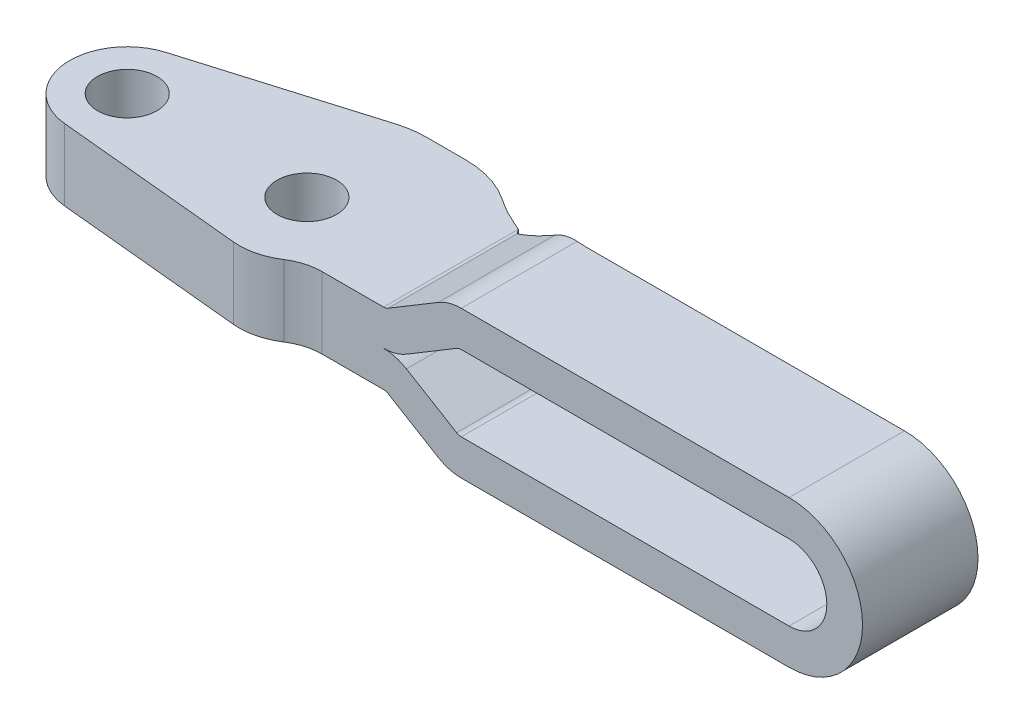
ISO-10303-21;
HEADER;
FILE_DESCRIPTION(('STEP AP214'),'2;1');
FILE_NAME('part.step','',(''),(''),'','','');
FILE_SCHEMA(('AUTOMOTIVE_DESIGN { 1 0 10303 214 1 1 1 1 }'));
ENDSEC;
DATA;
#1=APPLICATION_CONTEXT('core data for automotive mechanical design processes');
#2=APPLICATION_PROTOCOL_DEFINITION('international standard','automotive_design',2000,#1);
#3=PRODUCT_CONTEXT('',#1,'mechanical');
#4=PRODUCT('Part','Part','',(#3));
#5=PRODUCT_RELATED_PRODUCT_CATEGORY('part','',(#4));
#6=PRODUCT_DEFINITION_FORMATION('','',#4);
#7=PRODUCT_DEFINITION_CONTEXT('part definition',#1,'design');
#8=PRODUCT_DEFINITION('design','',#6,#7);
#9=PRODUCT_DEFINITION_SHAPE('','',#8);
#10=(LENGTH_UNIT() NAMED_UNIT(*) SI_UNIT(.MILLI.,.METRE.));
#11=(NAMED_UNIT(*) PLANE_ANGLE_UNIT() SI_UNIT($,.RADIAN.));
#12=(NAMED_UNIT(*) SI_UNIT($,.STERADIAN.) SOLID_ANGLE_UNIT());
#13=UNCERTAINTY_MEASURE_WITH_UNIT(LENGTH_MEASURE(1.E-05),#10,'distance_accuracy_value','');
#14=(GEOMETRIC_REPRESENTATION_CONTEXT(3) GLOBAL_UNCERTAINTY_ASSIGNED_CONTEXT((#13)) GLOBAL_UNIT_ASSIGNED_CONTEXT((#10,
#11,#12)) REPRESENTATION_CONTEXT('',''));
#15=CARTESIAN_POINT('',(0.,0.,0.));
#16=DIRECTION('',(0.,0.,1.));
#17=DIRECTION('',(1.,0.,0.));
#18=AXIS2_PLACEMENT_3D('',#15,#16,#17);
#19=CARTESIAN_POINT('',(32.818978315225,2.43499999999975,-5.0212483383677));
#20=DIRECTION('',(0.,0.,1.));
#21=DIRECTION('',(1.,0.,0.));
#22=AXIS2_PLACEMENT_3D('',#19,#20,#21);
#23=PLANE('',#22);
#24=CARTESIAN_POINT('',(32.818978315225,2.43499999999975,-5.0212483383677));
#25=DIRECTION('',(0.,0.,1.));
#26=DIRECTION('',(1.,0.,0.));
#27=AXIS2_PLACEMENT_3D('',#24,#25,#26);
#28=CIRCLE('',#27,3.74);
#29=CARTESIAN_POINT('',(31.8189952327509,6.03883598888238,-5.0212483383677));
#30=VERTEX_POINT('',#29);
#31=CARTESIAN_POINT('',(30.8927359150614,5.64080570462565,-5.02124833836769));
#32=VERTEX_POINT('',#31);
#33=EDGE_CURVE('E509',#30,#32,#28,.T.);
#34=ORIENTED_EDGE('',*,*,#33,.F.);
#35=DIRECTION('',(-0.178536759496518,0.983933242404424,0.));
#36=VECTOR('',#35,1.);
#37=CARTESIAN_POINT('',(32.3232003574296,3.2601130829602,-5.0212483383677));
#38=LINE('',#37,#36);
#39=CARTESIAN_POINT('',(32.3232003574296,3.2601130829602,-5.0212483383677));
#40=VERTEX_POINT('',#39);
#41=EDGE_CURVE('E1295',#40,#30,#38,.T.);
#42=ORIENTED_EDGE('',*,*,#41,.F.);
#43=CARTESIAN_POINT('',(32.4014810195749,3.04841516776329,-5.01887539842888));
#44=DIRECTION('',(-0.346804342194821,0.937878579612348,-0.0105127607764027));
#45=VECTOR('',#44,1.);
#46=LINE('',#43,#45);
#47=CARTESIAN_POINT('',(32.40193784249,3.04787451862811,-5.02030469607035));
#48=VERTEX_POINT('',#47);
#49=EDGE_CURVE('E520',#48,#40,#46,.T.);
#50=ORIENTED_EDGE('',*,*,#49,.F.);
#51=DIRECTION('',(0.857167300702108,0.515038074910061,0.));
#52=VECTOR('',#51,1.);
#53=CARTESIAN_POINT('',(92.3610994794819,39.0748244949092,-5.02124833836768));
#54=LINE('',#53,#52);
#55=CARTESIAN_POINT('',(32.2547485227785,2.95928525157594,-5.02124833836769));
#56=VERTEX_POINT('',#55);
#57=EDGE_CURVE('E513',#56,#48,#54,.T.);
#58=ORIENTED_EDGE('',*,*,#57,.F.);
#59=DIRECTION('',(-0.515038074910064,0.857167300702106,0.));
#60=VECTOR('',#59,1.);
#61=CARTESIAN_POINT('',(32.2547485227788,2.95928525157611,-5.02124833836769));
#62=LINE('',#61,#60);
#63=CARTESIAN_POINT('',(30.7096342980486,5.53078715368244,-5.02124833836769));
#64=VERTEX_POINT('',#63);
#65=EDGE_CURVE('E527',#56,#64,#62,.T.);
#66=ORIENTED_EDGE('',*,*,#65,.T.);
#67=DIRECTION('',(-0.857167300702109,-0.51503807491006,0.));
#68=VECTOR('',#67,1.);
#69=CARTESIAN_POINT('',(30.8927359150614,5.64080570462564,-5.02124833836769));
#70=LINE('',#69,#68);
#71=EDGE_CURVE('E516',#32,#64,#70,.T.);
#72=ORIENTED_EDGE('',*,*,#71,.F.);
#73=EDGE_LOOP('',(#34,#42,#50,#58,#66,#72));
#74=FACE_BOUND('',#73,.T.);
#75=ADVANCED_FACE('F14',(#74),#23,.F.);
#76=CARTESIAN_POINT('',(31.8014964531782,-2.68694393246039,-5.07466458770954));
#77=DIRECTION('',(-0.0861509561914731,0.0517647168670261,0.994936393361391));
#78=DIRECTION('',(0.996272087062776,0.,0.0862666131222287));
#79=AXIS2_PLACEMENT_3D('',#76,#77,#78);
#80=PLANE('',#79);
#81=DIRECTION('',(-0.515038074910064,-0.857167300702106,0.));
#82=VECTOR('',#81,1.);
#83=CARTESIAN_POINT('',(32.2547485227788,-2.95928525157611,-5.02124833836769));
#84=LINE('',#83,#82);
#85=CARTESIAN_POINT('',(32.2547485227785,-2.95928525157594,-5.02124833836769));
#86=VERTEX_POINT('',#85);
#87=CARTESIAN_POINT('',(30.7096342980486,-5.53078715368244,-5.02124833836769));
#88=VERTEX_POINT('',#87);
#89=EDGE_CURVE('E1319',#86,#88,#84,.T.);
#90=ORIENTED_EDGE('',*,*,#89,.T.);
#91=DIRECTION('',(0.852826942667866,-0.512430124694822,0.100506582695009));
#92=VECTOR('',#91,1.);
#93=CARTESIAN_POINT('',(30.2563822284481,-5.25844583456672,-5.07466458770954));
#94=LINE('',#93,#92);
#95=CARTESIAN_POINT('',(30.2563822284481,-5.25844583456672,-5.07466458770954));
#96=VERTEX_POINT('',#95);
#97=EDGE_CURVE('E512',#96,#88,#94,.T.);
#98=ORIENTED_EDGE('',*,*,#97,.F.);
#99=DIRECTION('',(0.515038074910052,0.857167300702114,0.));
#100=VECTOR('',#99,1.);
#101=CARTESIAN_POINT('',(30.2563822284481,-5.25844583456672,-5.07466458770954));
#102=LINE('',#101,#100);
#103=CARTESIAN_POINT('',(31.8014964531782,-2.68694393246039,-5.07466458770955));
#104=VERTEX_POINT('',#103);
#105=EDGE_CURVE('E1283',#96,#104,#102,.T.);
#106=ORIENTED_EDGE('',*,*,#105,.T.);
#107=DIRECTION('',(-0.852826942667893,0.512430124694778,-0.100506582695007));
#108=VECTOR('',#107,1.);
#109=CARTESIAN_POINT('',(32.2547485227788,-2.95928525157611,-5.02124833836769));
#110=LINE('',#109,#108);
#111=EDGE_CURVE('E1307',#86,#104,#110,.T.);
#112=ORIENTED_EDGE('',*,*,#111,.F.);
#113=EDGE_LOOP('',(#90,#98,#106,#112));
#114=FACE_BOUND('',#113,.T.);
#115=ADVANCED_FACE('F1050',(#114),#80,.F.);
#116=CARTESIAN_POINT('',(31.8014964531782,2.68694393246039,-5.07466458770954));
#117=DIRECTION('',(-0.0861509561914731,-0.0517647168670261,0.994936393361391));
#118=DIRECTION('',(0.996272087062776,0.,0.0862666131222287));
#119=AXIS2_PLACEMENT_3D('',#116,#117,#118);
#120=PLANE('',#119);
#121=DIRECTION('',(-0.515038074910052,0.857167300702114,0.));
#122=VECTOR('',#121,1.);
#123=CARTESIAN_POINT('',(31.8014964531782,2.68694393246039,-5.07466458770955));
#124=LINE('',#123,#122);
#125=CARTESIAN_POINT('',(31.8014964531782,2.68694393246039,-5.07466458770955));
#126=VERTEX_POINT('',#125);
#127=CARTESIAN_POINT('',(30.2563822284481,5.25844583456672,-5.07466458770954));
#128=VERTEX_POINT('',#127);
#129=EDGE_CURVE('E1272',#126,#128,#124,.T.);
#130=ORIENTED_EDGE('',*,*,#129,.T.);
#131=DIRECTION('',(-0.852826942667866,-0.512430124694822,-0.100506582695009));
#132=VECTOR('',#131,1.);
#133=CARTESIAN_POINT('',(30.7096342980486,5.53078715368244,-5.02124833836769));
#134=LINE('',#133,#132);
#135=EDGE_CURVE('E1415',#64,#128,#134,.T.);
#136=ORIENTED_EDGE('',*,*,#135,.F.);
#137=ORIENTED_EDGE('',*,*,#65,.F.);
#138=DIRECTION('',(0.852826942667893,0.512430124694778,0.100506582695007));
#139=VECTOR('',#138,1.);
#140=CARTESIAN_POINT('',(31.8014964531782,2.68694393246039,-5.07466458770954));
#141=LINE('',#140,#139);
#142=EDGE_CURVE('E1304',#126,#56,#141,.T.);
#143=ORIENTED_EDGE('',*,*,#142,.F.);
#144=EDGE_LOOP('',(#130,#136,#137,#143));
#145=FACE_BOUND('',#144,.T.);
#146=ADVANCED_FACE('F551',(#145),#120,.F.);
#147=CARTESIAN_POINT('',(32.151250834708,6.11491032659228,-5.0006507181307));
#148=DIRECTION('',(0.0594118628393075,0.0107804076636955,-0.998175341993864));
#149=DIRECTION('',(-0.998233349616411,0.,-0.0594153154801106));
#150=AXIS2_PLACEMENT_3D('',#147,#148,#149);
#151=PLANE('',#150);
#152=ORIENTED_EDGE('',*,*,#41,.T.);
#153=CARTESIAN_POINT('',(31.8189952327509,6.03883598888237,-5.0212483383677));
#154=CARTESIAN_POINT('',(31.9833879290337,6.08445124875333,-5.01097095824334));
#155=CARTESIAN_POINT('',(32.151250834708,6.1149103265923,-5.0006507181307));
#156=B_SPLINE_CURVE_WITH_KNOTS('',2,(#153,#154,#155),.UNSPECIFIED.,.F.,.F.,(3,3),(0.,1.),.UNSPECIFIED.);
#157=CARTESIAN_POINT('',(32.1512480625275,6.1149105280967,-5.00057600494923));
#158=VERTEX_POINT('',#157);
#159=EDGE_CURVE('E1296',#30,#158,#156,.T.);
#160=ORIENTED_EDGE('',*,*,#159,.T.);
#161=CARTESIAN_POINT('',(32.685930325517,3.16311059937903,-4.97826717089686));
#162=DIRECTION('',(-0.178233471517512,0.983960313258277,-0.00741158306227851));
#163=VECTOR('',#162,1.);
#164=LINE('',#161,#163);
#165=CARTESIAN_POINT('',(32.6864458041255,3.16314078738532,-4.98945770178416));
#166=VERTEX_POINT('',#165);
#167=EDGE_CURVE('E581',#166,#158,#164,.T.);
#168=ORIENTED_EDGE('',*,*,#167,.F.);
#169=CARTESIAN_POINT('',(32.6868611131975,3.16311059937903,-5.0006507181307));
#170=CARTESIAN_POINT('',(32.5349909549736,3.13555343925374,-5.00998772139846));
#171=CARTESIAN_POINT('',(32.4014810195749,3.04841516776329,-5.01887539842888));
#172=B_SPLINE_CURVE_WITH_KNOTS('',2,(#169,#170,#171),.UNSPECIFIED.,.F.,.F.,(3,3),(0.,1.),.UNSPECIFIED.);
#173=EDGE_CURVE('E505',#166,#48,#172,.T.);
#174=ORIENTED_EDGE('',*,*,#173,.T.);
#175=ORIENTED_EDGE('',*,*,#49,.T.);
#176=EDGE_LOOP('',(#152,#160,#168,#174,#175));
#177=FACE_BOUND('',#176,.T.);
#178=ADVANCED_FACE('F540',(#177),#151,.T.);
#179=CARTESIAN_POINT('',(30.8393398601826,-2.10882192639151,-5.24418282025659));
#180=DIRECTION('',(-0.127998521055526,0.0769092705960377,0.988787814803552));
#181=DIRECTION('',(0.991725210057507,0.,0.128378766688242));
#182=AXIS2_PLACEMENT_3D('',#179,#180,#181);
#183=PLANE('',#182);
#184=DIRECTION('',(0.515038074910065,0.857167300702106,0.));
#185=VECTOR('',#184,1.);
#186=CARTESIAN_POINT('',(29.2942256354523,-4.68032382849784,-5.24418282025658));
#187=LINE('',#186,#185);
#188=CARTESIAN_POINT('',(29.2942256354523,-4.68032382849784,-5.24418282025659));
#189=VERTEX_POINT('',#188);
#190=CARTESIAN_POINT('',(30.8393398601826,-2.10882192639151,-5.24418282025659));
#191=VERTEX_POINT('',#190);
#192=EDGE_CURVE('E628',#189,#191,#187,.T.);
#193=ORIENTED_EDGE('',*,*,#192,.T.);
#194=DIRECTION('',(-0.847556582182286,0.509263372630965,-0.149327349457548));
#195=VECTOR('',#194,1.);
#196=CARTESIAN_POINT('',(31.8014964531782,-2.68694393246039,-5.07466458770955));
#197=LINE('',#196,#195);
#198=EDGE_CURVE('E1282',#104,#191,#197,.T.);
#199=ORIENTED_EDGE('',*,*,#198,.F.);
#200=ORIENTED_EDGE('',*,*,#105,.F.);
#201=DIRECTION('',(0.847556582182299,-0.509263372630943,0.149327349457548));
#202=VECTOR('',#201,1.);
#203=CARTESIAN_POINT('',(29.2942256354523,-4.68032382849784,-5.24418282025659));
#204=LINE('',#203,#202);
#205=EDGE_CURVE('E1276',#189,#96,#204,.T.);
#206=ORIENTED_EDGE('',*,*,#205,.F.);
#207=EDGE_LOOP('',(#193,#199,#200,#206));
#208=FACE_BOUND('',#207,.T.);
#209=ADVANCED_FACE('F550',(#208),#183,.F.);
#210=CARTESIAN_POINT('',(30.8393398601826,2.10882192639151,-5.24418282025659));
#211=DIRECTION('',(-0.127998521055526,-0.0769092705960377,0.988787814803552));
#212=DIRECTION('',(0.991725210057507,0.,0.128378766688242));
#213=AXIS2_PLACEMENT_3D('',#210,#211,#212);
#214=PLANE('',#213);
#215=ORIENTED_EDGE('',*,*,#129,.F.);
#216=DIRECTION('',(0.847556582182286,0.509263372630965,0.149327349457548));
#217=VECTOR('',#216,1.);
#218=CARTESIAN_POINT('',(30.8393398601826,2.10882192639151,-5.24418282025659));
#219=LINE('',#218,#217);
#220=CARTESIAN_POINT('',(30.8393398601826,2.10882192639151,-5.24418282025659));
#221=VERTEX_POINT('',#220);
#222=EDGE_CURVE('E1273',#221,#126,#219,.T.);
#223=ORIENTED_EDGE('',*,*,#222,.F.);
#224=DIRECTION('',(-0.515038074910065,0.857167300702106,0.));
#225=VECTOR('',#224,1.);
#226=CARTESIAN_POINT('',(30.8393398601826,2.10882192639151,-5.24418282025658));
#227=LINE('',#226,#225);
#228=CARTESIAN_POINT('',(29.2942256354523,4.68032382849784,-5.24418282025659));
#229=VERTEX_POINT('',#228);
#230=EDGE_CURVE('E1261',#221,#229,#227,.T.);
#231=ORIENTED_EDGE('',*,*,#230,.T.);
#232=DIRECTION('',(-0.847556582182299,-0.509263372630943,-0.149327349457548));
#233=VECTOR('',#232,1.);
#234=CARTESIAN_POINT('',(30.2563822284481,5.25844583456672,-5.07466458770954));
#235=LINE('',#234,#233);
#236=EDGE_CURVE('E499',#128,#229,#235,.T.);
#237=ORIENTED_EDGE('',*,*,#236,.F.);
#238=EDGE_LOOP('',(#215,#223,#231,#237));
#239=FACE_BOUND('',#238,.T.);
#240=ADVANCED_FACE('F1423',(#239),#214,.F.);
#241=CARTESIAN_POINT('',(32.818978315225,-2.43499999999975,-5.0212483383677));
#242=DIRECTION('',(0.,0.,1.));
#243=DIRECTION('',(1.,0.,0.));
#244=AXIS2_PLACEMENT_3D('',#241,#242,#243);
#245=PLANE('',#244);
#246=DIRECTION('',(0.178536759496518,0.983933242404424,0.));
#247=VECTOR('',#246,1.);
#248=CARTESIAN_POINT('',(31.8189952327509,-6.03883598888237,-5.0212483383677));
#249=LINE('',#248,#247);
#250=CARTESIAN_POINT('',(31.8189952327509,-6.03883598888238,-5.0212483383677));
#251=VERTEX_POINT('',#250);
#252=CARTESIAN_POINT('',(32.3232003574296,-3.2601130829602,-5.0212483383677));
#253=VERTEX_POINT('',#252);
#254=EDGE_CURVE('E653',#251,#253,#249,.T.);
#255=ORIENTED_EDGE('',*,*,#254,.F.);
#256=CARTESIAN_POINT('',(32.818978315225,-2.43499999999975,-5.02124833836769));
#257=DIRECTION('',(0.,0.,1.));
#258=DIRECTION('',(1.,0.,0.));
#259=AXIS2_PLACEMENT_3D('',#256,#257,#258);
#260=CIRCLE('',#259,3.74);
#261=CARTESIAN_POINT('',(30.8927359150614,-5.64080570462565,-5.02124833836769));
#262=VERTEX_POINT('',#261);
#263=EDGE_CURVE('E495',#262,#251,#260,.T.);
#264=ORIENTED_EDGE('',*,*,#263,.F.);
#265=DIRECTION('',(0.857167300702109,-0.51503807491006,0.));
#266=VECTOR('',#265,1.);
#267=CARTESIAN_POINT('',(30.7096342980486,-5.53078715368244,-5.02124833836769));
#268=LINE('',#267,#266);
#269=EDGE_CURVE('E587',#88,#262,#268,.T.);
#270=ORIENTED_EDGE('',*,*,#269,.F.);
#271=ORIENTED_EDGE('',*,*,#89,.F.);
#272=DIRECTION('',(-0.857167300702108,0.515038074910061,0.));
#273=VECTOR('',#272,1.);
#274=CARTESIAN_POINT('',(92.3610994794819,-39.0748244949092,-5.02124833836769));
#275=LINE('',#274,#273);
#276=CARTESIAN_POINT('',(32.40193784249,-3.04787451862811,-5.02030469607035));
#277=VERTEX_POINT('',#276);
#278=EDGE_CURVE('E502',#277,#86,#275,.T.);
#279=ORIENTED_EDGE('',*,*,#278,.F.);
#280=CARTESIAN_POINT('',(32.3232003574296,-3.26011308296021,-5.0212483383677));
#281=DIRECTION('',(0.346804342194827,0.937878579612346,0.010512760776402));
#282=VECTOR('',#281,1.);
#283=LINE('',#280,#282);
#284=EDGE_CURVE('E506',#253,#277,#283,.T.);
#285=ORIENTED_EDGE('',*,*,#284,.F.);
#286=EDGE_LOOP('',(#255,#264,#270,#271,#279,#285));
#287=FACE_BOUND('',#286,.T.);
#288=ADVANCED_FACE('F600',(#287),#245,.F.);
#289=CARTESIAN_POINT('',(32.8189783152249,6.17499999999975,-4.97273456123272));
#290=DIRECTION('',(0.0415476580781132,0.,-0.99913652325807));
#291=DIRECTION('',(-0.99913652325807,0.,-0.0415476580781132));
#292=AXIS2_PLACEMENT_3D('',#289,#290,#291);
#293=PLANE('',#292);
#294=ORIENTED_EDGE('',*,*,#167,.T.);
#295=CARTESIAN_POINT('',(32.1512446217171,6.1149103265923,-5.00050130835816));
#296=CARTESIAN_POINT('',(32.4824108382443,6.17499999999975,-4.98673023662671));
#297=CARTESIAN_POINT('',(32.8189783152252,6.17499999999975,-4.97273456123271));
#298=B_SPLINE_CURVE_WITH_KNOTS('',2,(#295,#296,#297),.UNSPECIFIED.,.F.,.F.,(3,3),(0.,1.),.UNSPECIFIED.);
#299=CARTESIAN_POINT('',(32.8189783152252,6.17499999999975,-4.97273456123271));
#300=VERTEX_POINT('',#299);
#301=EDGE_CURVE('E621',#158,#300,#298,.T.);
#302=ORIENTED_EDGE('',*,*,#301,.T.);
#303=DIRECTION('',(0.,1.,0.));
#304=VECTOR('',#303,1.);
#305=CARTESIAN_POINT('',(32.8189783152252,3.17499999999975,-4.97273456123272));
#306=LINE('',#305,#304);
#307=CARTESIAN_POINT('',(32.8280797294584,3.17499999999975,-4.97210265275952));
#308=VERTEX_POINT('',#307);
#309=EDGE_CURVE('E624',#300,#308,#306,.F.);
#310=ORIENTED_EDGE('',*,*,#309,.T.);
#311=CARTESIAN_POINT('',(32.8189783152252,3.17499999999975,-4.97273456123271));
#312=CARTESIAN_POINT('',(32.7523986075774,3.17499999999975,-4.97550318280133));
#313=CARTESIAN_POINT('',(32.685930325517,3.16311059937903,-4.97826717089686));
#314=B_SPLINE_CURVE_WITH_KNOTS('',2,(#311,#312,#313),.UNSPECIFIED.,.F.,.F.,(3,3),(0.,1.),.UNSPECIFIED.);
#315=EDGE_CURVE('E498',#308,#166,#314,.T.);
#316=ORIENTED_EDGE('',*,*,#315,.T.);
#317=EDGE_LOOP('',(#294,#302,#310,#316));
#318=FACE_BOUND('',#317,.T.);
#319=ADVANCED_FACE('F589',(#318),#293,.T.);
#320=CARTESIAN_POINT('',(30.3578022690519,-1.8194849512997,-5.35497448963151));
#321=DIRECTION('',(-0.165852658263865,0.0996543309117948,0.981102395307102));
#322=DIRECTION('',(0.986010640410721,0.,0.166682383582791));
#323=AXIS2_PLACEMENT_3D('',#320,#321,#322);
#324=PLANE('',#323);
#325=DIRECTION('',(0.515038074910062,0.857167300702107,0.));
#326=VECTOR('',#325,1.);
#327=CARTESIAN_POINT('',(28.8126880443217,-4.39098685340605,-5.3549744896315));
#328=LINE('',#327,#326);
#329=CARTESIAN_POINT('',(28.8126880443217,-4.39098685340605,-5.3549744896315));
#330=VERTEX_POINT('',#329);
#331=CARTESIAN_POINT('',(30.3578022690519,-1.8194849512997,-5.35497448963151));
#332=VERTEX_POINT('',#331);
#333=EDGE_CURVE('E647',#330,#332,#328,.T.);
#334=ORIENTED_EDGE('',*,*,#333,.T.);
#335=DIRECTION('',(-0.840968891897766,0.505305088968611,-0.193489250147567));
#336=VECTOR('',#335,1.);
#337=CARTESIAN_POINT('',(30.8393398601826,-2.10882192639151,-5.24418282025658));
#338=LINE('',#337,#336);
#339=EDGE_CURVE('E1279',#191,#332,#338,.T.);
#340=ORIENTED_EDGE('',*,*,#339,.F.);
#341=ORIENTED_EDGE('',*,*,#192,.F.);
#342=DIRECTION('',(0.840968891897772,-0.505305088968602,0.193489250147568));
#343=VECTOR('',#342,1.);
#344=CARTESIAN_POINT('',(28.8126880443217,-4.39098685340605,-5.35497448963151));
#345=LINE('',#344,#343);
#346=EDGE_CURVE('E1429',#330,#189,#345,.T.);
#347=ORIENTED_EDGE('',*,*,#346,.F.);
#348=EDGE_LOOP('',(#334,#340,#341,#347));
#349=FACE_BOUND('',#348,.T.);
#350=ADVANCED_FACE('F599',(#349),#324,.F.);
#351=CARTESIAN_POINT('',(30.3578022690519,1.8194849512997,-5.35497448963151));
#352=DIRECTION('',(-0.165852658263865,-0.0996543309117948,0.981102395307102));
#353=DIRECTION('',(0.986010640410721,0.,0.166682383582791));
#354=AXIS2_PLACEMENT_3D('',#351,#352,#353);
#355=PLANE('',#354);
#356=ORIENTED_EDGE('',*,*,#230,.F.);
#357=DIRECTION('',(0.840968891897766,0.505305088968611,0.193489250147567));
#358=VECTOR('',#357,1.);
#359=CARTESIAN_POINT('',(30.3578022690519,1.8194849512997,-5.35497448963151));
#360=LINE('',#359,#358);
#361=CARTESIAN_POINT('',(30.3578022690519,1.8194849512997,-5.35497448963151));
#362=VERTEX_POINT('',#361);
#363=EDGE_CURVE('E1270',#362,#221,#360,.T.);
#364=ORIENTED_EDGE('',*,*,#363,.F.);
#365=DIRECTION('',(-0.515038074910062,0.857167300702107,0.));
#366=VECTOR('',#365,1.);
#367=CARTESIAN_POINT('',(30.3578022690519,1.8194849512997,-5.3549744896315));
#368=LINE('',#367,#366);
#369=CARTESIAN_POINT('',(28.8126880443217,4.39098685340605,-5.3549744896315));
#370=VERTEX_POINT('',#369);
#371=EDGE_CURVE('E782',#362,#370,#368,.T.);
#372=ORIENTED_EDGE('',*,*,#371,.T.);
#373=DIRECTION('',(-0.840968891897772,-0.505305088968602,-0.193489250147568));
#374=VECTOR('',#373,1.);
#375=CARTESIAN_POINT('',(29.2942256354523,4.68032382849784,-5.24418282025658));
#376=LINE('',#375,#374);
#377=EDGE_CURVE('E1269',#229,#370,#376,.T.);
#378=ORIENTED_EDGE('',*,*,#377,.F.);
#379=EDGE_LOOP('',(#356,#364,#372,#378));
#380=FACE_BOUND('',#379,.T.);
#381=ADVANCED_FACE('F680',(#380),#355,.F.);
#382=CARTESIAN_POINT('',(32.151250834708,-6.11491032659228,-5.0006507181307));
#383=DIRECTION('',(0.0594118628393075,-0.0107804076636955,-0.998175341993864));
#384=DIRECTION('',(-0.998233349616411,0.,-0.0594153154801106));
#385=AXIS2_PLACEMENT_3D('',#382,#383,#384);
#386=PLANE('',#385);
#387=ORIENTED_EDGE('',*,*,#284,.T.);
#388=CARTESIAN_POINT('',(32.4014810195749,-3.04841516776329,-5.01887539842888));
#389=CARTESIAN_POINT('',(32.5350071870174,-3.1355563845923,-5.00998672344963));
#390=CARTESIAN_POINT('',(32.6868611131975,-3.16311059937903,-5.0006507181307));
#391=B_SPLINE_CURVE_WITH_KNOTS('',2,(#388,#389,#390),.UNSPECIFIED.,.F.,.F.,(3,3),(0.,1.),.UNSPECIFIED.);
#392=CARTESIAN_POINT('',(32.6864458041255,-3.16314078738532,-4.98945770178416));
#393=VERTEX_POINT('',#392);
#394=EDGE_CURVE('E651',#277,#393,#391,.T.);
#395=ORIENTED_EDGE('',*,*,#394,.T.);
#396=CARTESIAN_POINT('',(32.1512446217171,-6.1149103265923,-5.00050130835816));
#397=DIRECTION('',(0.178233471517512,0.983960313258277,0.00741158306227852));
#398=VECTOR('',#397,1.);
#399=LINE('',#396,#398);
#400=CARTESIAN_POINT('',(32.1512480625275,-6.1149105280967,-5.00057600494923));
#401=VERTEX_POINT('',#400);
#402=EDGE_CURVE('E703',#401,#393,#399,.T.);
#403=ORIENTED_EDGE('',*,*,#402,.F.);
#404=CARTESIAN_POINT('',(32.151250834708,-6.1149103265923,-5.0006507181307));
#405=CARTESIAN_POINT('',(31.9833879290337,-6.08445124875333,-5.01097095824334));
#406=CARTESIAN_POINT('',(31.8189952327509,-6.03883598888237,-5.0212483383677));
#407=B_SPLINE_CURVE_WITH_KNOTS('',2,(#404,#405,#406),.UNSPECIFIED.,.F.,.F.,(3,3),(0.,1.),.UNSPECIFIED.);
#408=EDGE_CURVE('E665',#401,#251,#407,.T.);
#409=ORIENTED_EDGE('',*,*,#408,.T.);
#410=ORIENTED_EDGE('',*,*,#254,.T.);
#411=EDGE_LOOP('',(#387,#395,#403,#409,#410));
#412=FACE_BOUND('',#411,.T.);
#413=ADVANCED_FACE('F671',(#412),#386,.T.);
#414=CARTESIAN_POINT('',(32.4169002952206,3.17499999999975,-5.0006507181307));
#415=DIRECTION('',(-0.0692629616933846,0.,0.99759843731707));
#416=DIRECTION('',(0.99759843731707,0.,0.0692629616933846));
#417=AXIS2_PLACEMENT_3D('',#414,#415,#416);
#418=PLANE('',#417);
#419=DIRECTION('',(0.99759843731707,0.,0.0692629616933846));
#420=VECTOR('',#419,1.);
#421=CARTESIAN_POINT('',(32.4169002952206,6.17499999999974,-5.0006507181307));
#422=LINE('',#421,#420);
#423=CARTESIAN_POINT('',(32.8371811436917,6.17499999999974,-4.97147074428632));
#424=VERTEX_POINT('',#423);
#425=EDGE_CURVE('E643',#424,#300,#422,.F.);
#426=ORIENTED_EDGE('',*,*,#425,.F.);
#427=DIRECTION('',(0.,1.,0.));
#428=VECTOR('',#427,1.);
#429=CARTESIAN_POINT('',(32.8371811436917,3.17499999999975,-4.97147074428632));
#430=LINE('',#429,#428);
#431=EDGE_CURVE('E645',#424,#308,#430,.F.);
#432=ORIENTED_EDGE('',*,*,#431,.T.);
#433=ORIENTED_EDGE('',*,*,#309,.F.);
#434=EDGE_LOOP('',(#426,#432,#433));
#435=FACE_BOUND('',#434,.T.);
#436=ADVANCED_FACE('F642',(#435),#418,.F.);
#437=CARTESIAN_POINT('',(29.8785293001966,-1.53150869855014,-5.48283018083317));
#438=DIRECTION('',(-0.191073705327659,0.114808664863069,0.974838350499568));
#439=DIRECTION('',(0.981327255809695,0.,0.192345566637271));
#440=AXIS2_PLACEMENT_3D('',#437,#438,#439);
#441=PLANE('',#440);
#442=DIRECTION('',(0.515038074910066,0.857167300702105,0.));
#443=VECTOR('',#442,1.);
#444=CARTESIAN_POINT('',(28.3334150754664,-4.10301060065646,-5.48283018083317));
#445=LINE('',#444,#443);
#446=CARTESIAN_POINT('',(28.3334150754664,-4.10301060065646,-5.48283018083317));
#447=VERTEX_POINT('',#446);
#448=CARTESIAN_POINT('',(29.8785293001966,-1.53150869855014,-5.48283018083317));
#449=VERTEX_POINT('',#448);
#450=EDGE_CURVE('E787',#447,#449,#445,.T.);
#451=ORIENTED_EDGE('',*,*,#450,.T.);
#452=DIRECTION('',(-0.835599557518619,0.502078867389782,-0.222912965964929));
#453=VECTOR('',#452,1.);
#454=CARTESIAN_POINT('',(30.3578022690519,-1.8194849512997,-5.3549744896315));
#455=LINE('',#454,#453);
#456=EDGE_CURVE('E793',#332,#449,#455,.T.);
#457=ORIENTED_EDGE('',*,*,#456,.F.);
#458=ORIENTED_EDGE('',*,*,#333,.F.);
#459=DIRECTION('',(0.835599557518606,-0.502078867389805,0.222912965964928));
#460=VECTOR('',#459,1.);
#461=CARTESIAN_POINT('',(28.3334150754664,-4.10301060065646,-5.48283018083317));
#462=LINE('',#461,#460);
#463=EDGE_CURVE('E786',#447,#330,#462,.T.);
#464=ORIENTED_EDGE('',*,*,#463,.F.);
#465=EDGE_LOOP('',(#451,#457,#458,#464));
#466=FACE_BOUND('',#465,.T.);
#467=ADVANCED_FACE('F1444',(#466),#441,.F.);
#468=CARTESIAN_POINT('',(29.8785293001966,1.53150869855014,-5.48283018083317));
#469=DIRECTION('',(-0.191073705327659,-0.114808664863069,0.974838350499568));
#470=DIRECTION('',(0.981327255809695,0.,0.192345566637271));
#471=AXIS2_PLACEMENT_3D('',#468,#469,#470);
#472=PLANE('',#471);
#473=ORIENTED_EDGE('',*,*,#371,.F.);
#474=DIRECTION('',(0.835599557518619,0.502078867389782,0.222912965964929));
#475=VECTOR('',#474,1.);
#476=CARTESIAN_POINT('',(29.8785293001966,1.53150869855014,-5.48283018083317));
#477=LINE('',#476,#475);
#478=CARTESIAN_POINT('',(29.8785293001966,1.53150869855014,-5.48283018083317));
#479=VERTEX_POINT('',#478);
#480=EDGE_CURVE('E783',#479,#362,#477,.T.);
#481=ORIENTED_EDGE('',*,*,#480,.F.);
#482=DIRECTION('',(-0.515038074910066,0.857167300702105,0.));
#483=VECTOR('',#482,1.);
#484=CARTESIAN_POINT('',(29.8785293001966,1.53150869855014,-5.48283018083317));
#485=LINE('',#484,#483);
#486=CARTESIAN_POINT('',(28.3334150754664,4.10301060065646,-5.48283018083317));
#487=VERTEX_POINT('',#486);
#488=EDGE_CURVE('E775',#479,#487,#485,.T.);
#489=ORIENTED_EDGE('',*,*,#488,.T.);
#490=DIRECTION('',(-0.835599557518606,-0.502078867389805,-0.222912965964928));
#491=VECTOR('',#490,1.);
#492=CARTESIAN_POINT('',(28.8126880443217,4.39098685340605,-5.3549744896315));
#493=LINE('',#492,#491);
#494=EDGE_CURVE('E779',#370,#487,#493,.T.);
#495=ORIENTED_EDGE('',*,*,#494,.F.);
#496=EDGE_LOOP('',(#473,#481,#489,#495));
#497=FACE_BOUND('',#496,.T.);
#498=ADVANCED_FACE('F722',(#497),#472,.F.);
#499=CARTESIAN_POINT('',(32.8189783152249,-6.17499999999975,-4.97273456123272));
#500=DIRECTION('',(0.0415476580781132,0.,-0.99913652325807));
#501=DIRECTION('',(-0.99913652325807,0.,-0.0415476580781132));
#502=AXIS2_PLACEMENT_3D('',#499,#500,#501);
#503=PLANE('',#502);
#504=ORIENTED_EDGE('',*,*,#402,.T.);
#505=CARTESIAN_POINT('',(32.685930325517,-3.16311059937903,-4.97826717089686));
#506=CARTESIAN_POINT('',(32.7523986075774,-3.17499999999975,-4.97550318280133));
#507=CARTESIAN_POINT('',(32.8189783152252,-3.17499999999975,-4.97273456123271));
#508=B_SPLINE_CURVE_WITH_KNOTS('',2,(#505,#506,#507),.UNSPECIFIED.,.F.,.F.,(3,3),(0.,1.),.UNSPECIFIED.);
#509=CARTESIAN_POINT('',(32.8280797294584,-3.17499999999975,-4.97210265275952));
#510=VERTEX_POINT('',#509);
#511=EDGE_CURVE('E742',#393,#510,#508,.T.);
#512=ORIENTED_EDGE('',*,*,#511,.T.);
#513=DIRECTION('',(0.,1.,0.));
#514=VECTOR('',#513,1.);
#515=CARTESIAN_POINT('',(32.8189783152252,-3.17499999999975,-4.97273456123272));
#516=LINE('',#515,#514);
#517=CARTESIAN_POINT('',(32.8189783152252,-6.17499999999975,-4.97273456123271));
#518=VERTEX_POINT('',#517);
#519=EDGE_CURVE('E745',#510,#518,#516,.F.);
#520=ORIENTED_EDGE('',*,*,#519,.T.);
#521=CARTESIAN_POINT('',(32.8189783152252,-6.17499999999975,-4.97273456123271));
#522=CARTESIAN_POINT('',(32.4824108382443,-6.17499999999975,-4.98673023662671));
#523=CARTESIAN_POINT('',(32.1512446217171,-6.1149103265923,-5.00050130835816));
#524=B_SPLINE_CURVE_WITH_KNOTS('',2,(#521,#522,#523),.UNSPECIFIED.,.F.,.F.,(3,3),(0.,1.),.UNSPECIFIED.);
#525=EDGE_CURVE('E781',#518,#401,#524,.T.);
#526=ORIENTED_EDGE('',*,*,#525,.T.);
#527=EDGE_LOOP('',(#504,#512,#520,#526));
#528=FACE_BOUND('',#527,.T.);
#529=ADVANCED_FACE('F711',(#528),#503,.T.);
#530=CARTESIAN_POINT('',(32.8371811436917,3.17499999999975,-4.97147074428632));
#531=DIRECTION('',(-0.0489156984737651,0.,0.998802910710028));
#532=DIRECTION('',(0.998802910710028,0.,0.0489156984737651));
#533=AXIS2_PLACEMENT_3D('',#530,#531,#532);
#534=PLANE('',#533);
#535=DIRECTION('',(0.,1.,0.));
#536=VECTOR('',#535,1.);
#537=CARTESIAN_POINT('',(33.2757402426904,3.17499999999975,-4.9499926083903));
#538=LINE('',#537,#536);
#539=CARTESIAN_POINT('',(33.2757402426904,6.17499999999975,-4.94999260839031));
#540=VERTEX_POINT('',#539);
#541=CARTESIAN_POINT('',(33.2757402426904,3.17499999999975,-4.94999260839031));
#542=VERTEX_POINT('',#541);
#543=EDGE_CURVE('E494',#540,#542,#538,.F.);
#544=ORIENTED_EDGE('',*,*,#543,.T.);
#545=DIRECTION('',(0.998802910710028,0.,0.0489156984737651));
#546=VECTOR('',#545,1.);
#547=CARTESIAN_POINT('',(32.8371811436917,3.17499999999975,-4.97147074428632));
#548=LINE('',#547,#546);
#549=EDGE_CURVE('E794',#308,#542,#548,.T.);
#550=ORIENTED_EDGE('',*,*,#549,.F.);
#551=ORIENTED_EDGE('',*,*,#431,.F.);
#552=DIRECTION('',(0.998802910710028,0.,0.0489156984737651));
#553=VECTOR('',#552,1.);
#554=CARTESIAN_POINT('',(32.8371811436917,6.17499999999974,-4.97147074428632));
#555=LINE('',#554,#553);
#556=EDGE_CURVE('E650',#540,#424,#555,.F.);
#557=ORIENTED_EDGE('',*,*,#556,.F.);
#558=EDGE_LOOP('',(#544,#550,#551,#557));
#559=FACE_BOUND('',#558,.T.);
#560=ADVANCED_FACE('F721',(#559),#534,.F.);
#561=CARTESIAN_POINT('',(29.8785293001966,-1.53150869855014,-5.48283018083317));
#562=DIRECTION('',(-0.232088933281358,0.139453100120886,0.962646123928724));
#563=DIRECTION('',(0.972145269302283,0.,0.234379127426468));
#564=AXIS2_PLACEMENT_3D('',#561,#562,#563);
#565=PLANE('',#564);
#566=DIRECTION('',(0.515038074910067,0.857167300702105,0.));
#567=VECTOR('',#566,1.);
#568=CARTESIAN_POINT('',(27.2603430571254,-3.45824388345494,-5.83494592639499));
#569=LINE('',#568,#567);
#570=CARTESIAN_POINT('',(27.2603430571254,-3.45824388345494,-5.83494592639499));
#571=VERTEX_POINT('',#570);
#572=CARTESIAN_POINT('',(28.8054572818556,-0.886741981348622,-5.83494592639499));
#573=VERTEX_POINT('',#572);
#574=EDGE_CURVE('E806',#571,#573,#569,.T.);
#575=ORIENTED_EDGE('',*,*,#574,.T.);
#576=DIRECTION('',(-0.825148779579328,0.495799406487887,-0.270762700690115));
#577=VECTOR('',#576,1.);
#578=CARTESIAN_POINT('',(29.8785293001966,-1.53150869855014,-5.48283018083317));
#579=LINE('',#578,#577);
#580=EDGE_CURVE('E790',#449,#573,#579,.T.);
#581=ORIENTED_EDGE('',*,*,#580,.F.);
#582=ORIENTED_EDGE('',*,*,#450,.F.);
#583=DIRECTION('',(0.825148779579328,-0.495799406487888,0.270762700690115));
#584=VECTOR('',#583,1.);
#585=CARTESIAN_POINT('',(27.2603430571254,-3.45824388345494,-5.83494592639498));
#586=LINE('',#585,#584);
#587=EDGE_CURVE('E802',#571,#447,#586,.T.);
#588=ORIENTED_EDGE('',*,*,#587,.F.);
#589=EDGE_LOOP('',(#575,#581,#582,#588));
#590=FACE_BOUND('',#589,.T.);
#591=ADVANCED_FACE('F967',(#590),#565,.F.);
#592=CARTESIAN_POINT('',(29.8785293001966,1.53150869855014,-5.48283018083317));
#593=DIRECTION('',(-0.232088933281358,-0.139453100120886,0.962646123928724));
#594=DIRECTION('',(0.972145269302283,0.,0.234379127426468));
#595=AXIS2_PLACEMENT_3D('',#592,#593,#594);
#596=PLANE('',#595);
#597=ORIENTED_EDGE('',*,*,#488,.F.);
#598=DIRECTION('',(0.825148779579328,0.495799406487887,0.270762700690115));
#599=VECTOR('',#598,1.);
#600=CARTESIAN_POINT('',(28.8054572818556,0.88674198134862,-5.83494592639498));
#601=LINE('',#600,#599);
#602=CARTESIAN_POINT('',(28.8054572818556,0.886741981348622,-5.83494592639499));
#603=VERTEX_POINT('',#602);
#604=EDGE_CURVE('E778',#603,#479,#601,.T.);
#605=ORIENTED_EDGE('',*,*,#604,.F.);
#606=DIRECTION('',(-0.515038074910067,0.857167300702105,0.));
#607=VECTOR('',#606,1.);
#608=CARTESIAN_POINT('',(28.8054572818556,0.886741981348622,-5.83494592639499));
#609=LINE('',#608,#607);
#610=CARTESIAN_POINT('',(27.2603430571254,3.45824388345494,-5.83494592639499));
#611=VERTEX_POINT('',#610);
#612=EDGE_CURVE('E813',#603,#611,#609,.T.);
#613=ORIENTED_EDGE('',*,*,#612,.T.);
#614=DIRECTION('',(-0.825148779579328,-0.495799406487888,-0.270762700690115));
#615=VECTOR('',#614,1.);
#616=CARTESIAN_POINT('',(28.3334150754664,4.10301060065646,-5.48283018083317));
#617=LINE('',#616,#615);
#618=EDGE_CURVE('E770',#487,#611,#617,.T.);
#619=ORIENTED_EDGE('',*,*,#618,.F.);
#620=EDGE_LOOP('',(#597,#605,#613,#619));
#621=FACE_BOUND('',#620,.T.);
#622=ADVANCED_FACE('F965',(#621),#596,.F.);
#623=CARTESIAN_POINT('',(32.4169002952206,-3.17499999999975,-5.0006507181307));
#624=DIRECTION('',(-0.0692629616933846,0.,0.99759843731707));
#625=DIRECTION('',(0.99759843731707,0.,0.0692629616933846));
#626=AXIS2_PLACEMENT_3D('',#623,#624,#625);
#627=PLANE('',#626);
#628=DIRECTION('',(0.,1.,0.));
#629=VECTOR('',#628,1.);
#630=CARTESIAN_POINT('',(32.8371811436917,-3.17499999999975,-4.97147074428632));
#631=LINE('',#630,#629);
#632=CARTESIAN_POINT('',(32.8371811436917,-6.17499999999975,-4.97147074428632));
#633=VERTEX_POINT('',#632);
#634=EDGE_CURVE('E765',#510,#633,#631,.F.);
#635=ORIENTED_EDGE('',*,*,#634,.T.);
#636=DIRECTION('',(0.99759843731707,0.,0.0692629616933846));
#637=VECTOR('',#636,1.);
#638=CARTESIAN_POINT('',(32.4169002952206,-6.17499999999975,-5.0006507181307));
#639=LINE('',#638,#637);
#640=EDGE_CURVE('E766',#518,#633,#639,.T.);
#641=ORIENTED_EDGE('',*,*,#640,.F.);
#642=ORIENTED_EDGE('',*,*,#519,.F.);
#643=EDGE_LOOP('',(#635,#641,#642));
#644=FACE_BOUND('',#643,.T.);
#645=ADVANCED_FACE('F763',(#644),#627,.F.);
#646=CARTESIAN_POINT('',(33.9646617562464,3.17499999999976,-23.9395000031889));
#647=DIRECTION('',(0.,1.,0.));
#648=DIRECTION('',(-1.,0.,0.));
#649=AXIS2_PLACEMENT_3D('',#646,#647,#648);
#650=CYLINDRICAL_SURFACE('',#649,19.0019999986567);
#651=DIRECTION('',(0.,1.,0.));
#652=VECTOR('',#651,1.);
#653=CARTESIAN_POINT('',(33.9646617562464,3.17500000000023,-4.93750000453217));
#654=LINE('',#653,#652);
#655=CARTESIAN_POINT('',(33.9646617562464,6.17499999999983,-4.93750000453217));
#656=VERTEX_POINT('',#655);
#657=CARTESIAN_POINT('',(33.9646617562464,3.17499999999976,-4.93750000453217));
#658=VERTEX_POINT('',#657);
#659=EDGE_CURVE('E1377',#656,#658,#654,.F.);
#660=ORIENTED_EDGE('',*,*,#659,.T.);
#661=CARTESIAN_POINT('',(33.9646617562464,3.17499999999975,-23.9395000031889));
#662=DIRECTION('',(0.,1.,0.));
#663=DIRECTION('',(-1.,0.,0.));
#664=AXIS2_PLACEMENT_3D('',#661,#662,#663);
#665=CIRCLE('',#664,19.0019999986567);
#666=EDGE_CURVE('E492',#542,#658,#665,.T.);
#667=ORIENTED_EDGE('',*,*,#666,.F.);
#668=ORIENTED_EDGE('',*,*,#543,.F.);
#669=CARTESIAN_POINT('',(33.9646617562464,6.17499999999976,-23.9395000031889));
#670=DIRECTION('',(0.,1.,0.));
#671=DIRECTION('',(-1.,0.,0.));
#672=AXIS2_PLACEMENT_3D('',#669,#670,#671);
#673=CIRCLE('',#672,19.0019999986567);
#674=EDGE_CURVE('E488',#656,#540,#673,.F.);
#675=ORIENTED_EDGE('',*,*,#674,.F.);
#676=EDGE_LOOP('',(#660,#667,#668,#675));
#677=FACE_BOUND('',#676,.T.);
#678=ADVANCED_FACE('F958',(#677),#650,.F.);
#679=CARTESIAN_POINT('',(28.8054572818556,-0.886741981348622,-5.83494592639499));
#680=DIRECTION('',(-0.289299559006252,0.173828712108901,0.941323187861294));
#681=DIRECTION('',(0.955875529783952,0.,0.293771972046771));
#682=AXIS2_PLACEMENT_3D('',#679,#680,#681);
#683=PLANE('',#682);
#684=DIRECTION('',(-0.806871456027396,0.484817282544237,-0.337506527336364));
#685=VECTOR('',#684,1.);
#686=CARTESIAN_POINT('',(28.8054572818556,-0.886741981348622,-5.83494592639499));
#687=LINE('',#686,#685);
#688=CARTESIAN_POINT('',(28.218719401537,-0.534194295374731,-6.08037270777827));
#689=VERTEX_POINT('',#688);
#690=EDGE_CURVE('E809',#573,#689,#687,.T.);
#691=ORIENTED_EDGE('',*,*,#690,.F.);
#692=ORIENTED_EDGE('',*,*,#574,.F.);
#693=DIRECTION('',(0.806871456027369,-0.484817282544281,0.337506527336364));
#694=VECTOR('',#693,1.);
#695=CARTESIAN_POINT('',(26.6736051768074,-3.10569619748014,-6.08037270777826));
#696=LINE('',#695,#694);
#697=CARTESIAN_POINT('',(26.6736051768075,-3.10569619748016,-6.08037270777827));
#698=VERTEX_POINT('',#697);
#699=EDGE_CURVE('E491',#698,#571,#696,.T.);
#700=ORIENTED_EDGE('',*,*,#699,.F.);
#701=DIRECTION('',(-0.515038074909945,-0.857167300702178,0.));
#702=VECTOR('',#701,1.);
#703=CARTESIAN_POINT('',(27.4538878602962,-1.80708773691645,-6.08037270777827));
#704=LINE('',#703,#702);
#705=EDGE_CURVE('E1228',#689,#698,#704,.T.);
#706=ORIENTED_EDGE('',*,*,#705,.F.);
#707=EDGE_LOOP('',(#691,#692,#700,#706));
#708=FACE_BOUND('',#707,.T.);
#709=ADVANCED_FACE('F954',(#708),#683,.F.);
#710=CARTESIAN_POINT('',(28.8054572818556,0.886741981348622,-5.83494592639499));
#711=DIRECTION('',(-0.289299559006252,-0.173828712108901,0.941323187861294));
#712=DIRECTION('',(0.955875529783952,0.,0.293771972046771));
#713=AXIS2_PLACEMENT_3D('',#710,#711,#712);
#714=PLANE('',#713);
#715=DIRECTION('',(-0.806871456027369,-0.484817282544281,-0.337506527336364));
#716=VECTOR('',#715,1.);
#717=CARTESIAN_POINT('',(27.2603430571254,3.45824388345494,-5.83494592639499));
#718=LINE('',#717,#716);
#719=CARTESIAN_POINT('',(26.6736051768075,3.10569619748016,-6.08037270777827));
#720=VERTEX_POINT('',#719);
#721=EDGE_CURVE('E816',#611,#720,#718,.T.);
#722=ORIENTED_EDGE('',*,*,#721,.F.);
#723=ORIENTED_EDGE('',*,*,#612,.F.);
#724=DIRECTION('',(0.806871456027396,0.484817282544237,0.337506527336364));
#725=VECTOR('',#724,1.);
#726=CARTESIAN_POINT('',(28.2187194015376,0.534194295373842,-6.08037270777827));
#727=LINE('',#726,#725);
#728=CARTESIAN_POINT('',(28.2187194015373,0.534194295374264,-6.08037270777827));
#729=VERTEX_POINT('',#728);
#730=EDGE_CURVE('E817',#729,#603,#727,.T.);
#731=ORIENTED_EDGE('',*,*,#730,.F.);
#732=DIRECTION('',(-0.515038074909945,0.857167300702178,0.));
#733=VECTOR('',#732,1.);
#734=CARTESIAN_POINT('',(27.4538878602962,1.80708773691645,-6.08037270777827));
#735=LINE('',#734,#733);
#736=EDGE_CURVE('E1363',#729,#720,#735,.T.);
#737=ORIENTED_EDGE('',*,*,#736,.T.);
#738=EDGE_LOOP('',(#722,#723,#731,#737));
#739=FACE_BOUND('',#738,.T.);
#740=ADVANCED_FACE('F951',(#739),#714,.F.);
#741=CARTESIAN_POINT('',(32.8371811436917,-3.17499999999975,-4.97147074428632));
#742=DIRECTION('',(-0.0489156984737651,0.,0.998802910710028));
#743=DIRECTION('',(0.998802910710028,0.,0.0489156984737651));
#744=AXIS2_PLACEMENT_3D('',#741,#742,#743);
#745=PLANE('',#744);
#746=ORIENTED_EDGE('',*,*,#634,.F.);
#747=DIRECTION('',(0.998802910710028,0.,0.0489156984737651));
#748=VECTOR('',#747,1.);
#749=CARTESIAN_POINT('',(32.8371811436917,-3.17499999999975,-4.97147074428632));
#750=LINE('',#749,#748);
#751=CARTESIAN_POINT('',(33.2757402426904,-3.17499999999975,-4.94999260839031));
#752=VERTEX_POINT('',#751);
#753=EDGE_CURVE('E824',#752,#510,#750,.F.);
#754=ORIENTED_EDGE('',*,*,#753,.F.);
#755=DIRECTION('',(0.,-1.,0.));
#756=VECTOR('',#755,1.);
#757=CARTESIAN_POINT('',(33.2757402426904,-3.17499999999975,-4.9499926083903));
#758=LINE('',#757,#756);
#759=CARTESIAN_POINT('',(33.2757402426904,-6.17499999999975,-4.94999260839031));
#760=VERTEX_POINT('',#759);
#761=EDGE_CURVE('E847',#752,#760,#758,.T.);
#762=ORIENTED_EDGE('',*,*,#761,.T.);
#763=DIRECTION('',(0.998802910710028,0.,0.0489156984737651));
#764=VECTOR('',#763,1.);
#765=CARTESIAN_POINT('',(32.8371811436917,-6.17499999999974,-4.97147074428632));
#766=LINE('',#765,#764);
#767=EDGE_CURVE('E823',#633,#760,#766,.T.);
#768=ORIENTED_EDGE('',*,*,#767,.F.);
#769=EDGE_LOOP('',(#746,#754,#762,#768));
#770=FACE_BOUND('',#769,.T.);
#771=ADVANCED_FACE('F948',(#770),#745,.F.);
#772=CARTESIAN_POINT('',(60.3531516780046,0.,-17.9423697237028));
#773=DIRECTION('',(0.,0.,1.));
#774=DIRECTION('',(1.,0.,0.));
#775=AXIS2_PLACEMENT_3D('',#772,#773,#774);
#776=CYLINDRICAL_SURFACE('',#775,3.175);
#777=DIRECTION('',(0.,0.,1.));
#778=VECTOR('',#777,1.);
#779=CARTESIAN_POINT('',(60.3531516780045,3.17499999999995,-23.9395000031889));
#780=LINE('',#779,#778);
#781=CARTESIAN_POINT('',(60.3531516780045,3.175,-4.93750000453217));
#782=VERTEX_POINT('',#781);
#783=CARTESIAN_POINT('',(60.3531516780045,3.175,4.76249999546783));
#784=VERTEX_POINT('',#783);
#785=EDGE_CURVE('E912',#782,#784,#780,.T.);
#786=ORIENTED_EDGE('',*,*,#785,.F.);
#787=CARTESIAN_POINT('',(60.3531516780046,0.,-4.93750000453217));
#788=DIRECTION('',(0.,0.,1.));
#789=DIRECTION('',(1.,0.,0.));
#790=AXIS2_PLACEMENT_3D('',#787,#788,#789);
#791=CIRCLE('',#790,3.175);
#792=CARTESIAN_POINT('',(60.3531516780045,-3.17499999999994,-4.93750000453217));
#793=VERTEX_POINT('',#792);
#794=EDGE_CURVE('E889',#782,#793,#791,.F.);
#795=ORIENTED_EDGE('',*,*,#794,.T.);
#796=DIRECTION('',(0.,0.,1.));
#797=VECTOR('',#796,1.);
#798=CARTESIAN_POINT('',(60.3531516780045,-3.17499999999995,-23.9395000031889));
#799=LINE('',#798,#797);
#800=CARTESIAN_POINT('',(60.3531516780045,-3.17499999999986,4.76249999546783));
#801=VERTEX_POINT('',#800);
#802=EDGE_CURVE('E870',#801,#793,#799,.F.);
#803=ORIENTED_EDGE('',*,*,#802,.F.);
#804=CARTESIAN_POINT('',(60.3531516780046,0.,4.76249999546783));
#805=DIRECTION('',(0.,0.,1.));
#806=DIRECTION('',(1.,0.,0.));
#807=AXIS2_PLACEMENT_3D('',#804,#805,#806);
#808=CIRCLE('',#807,3.175);
#809=EDGE_CURVE('E884',#801,#784,#808,.T.);
#810=ORIENTED_EDGE('',*,*,#809,.T.);
#811=EDGE_LOOP('',(#786,#795,#803,#810));
#812=FACE_BOUND('',#811,.T.);
#813=ADVANCED_FACE('F944',(#812),#776,.F.);
#814=CARTESIAN_POINT('',(28.2341705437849,-0.508479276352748,-6.08037270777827));
#815=CARTESIAN_POINT('',(27.9371509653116,-0.330011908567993,-6.15419199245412));
#816=CARTESIAN_POINT('',(27.6155490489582,-0.192824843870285,-6.227977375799));
#817=CARTESIAN_POINT('',(27.2811641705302,-0.101951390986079,-6.30179666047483));
#818=CARTESIAN_POINT('',(28.2187194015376,-0.534194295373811,-6.08037270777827));
#819=CARTESIAN_POINT('',(27.9240634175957,-0.357147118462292,-6.15419193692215));
#820=CARTESIAN_POINT('',(27.6050205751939,-0.221051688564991,-6.22797743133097));
#821=CARTESIAN_POINT('',(27.2732966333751,-0.130901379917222,-6.30179666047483));
#822=CARTESIAN_POINT('',(26.6736051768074,-3.10569619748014,-6.08037270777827));
#823=CARTESIAN_POINT('',(26.6153086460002,-3.07066810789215,-6.15418638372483));
#824=CARTESIAN_POINT('',(26.5521731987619,-3.04373615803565,-6.22798298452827));
#825=CARTESIAN_POINT('',(26.4865429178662,-3.02590027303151,-6.30179666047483));
#826=B_SPLINE_SURFACE_WITH_KNOTS('',1,3,((#814,#815,#816,#817),(#818,#819,#820,#821),(#822,#823,
#824,#825)),.UNSPECIFIED.,.F.,.F.,.F.,(2,1,2),(4,4),(-0.01,0.,1.),(0.,1.),.UNSPECIFIED.);
#827=DIRECTION('',(-0.262251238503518,-0.964999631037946,0.));
#828=VECTOR('',#827,1.);
#829=CARTESIAN_POINT('',(26.8838535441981,-1.56392583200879,-6.30179666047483));
#830=LINE('',#829,#828);
#831=CARTESIAN_POINT('',(27.2732976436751,-0.130901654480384,-6.30179643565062));
#832=VERTEX_POINT('',#831);
#833=CARTESIAN_POINT('',(26.4865433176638,-3.02590038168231,-6.3017962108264));
#834=VERTEX_POINT('',#833);
#835=EDGE_CURVE('E881',#832,#834,#830,.T.);
#836=CARTESIAN_POINT('',(28.2187194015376,-0.534194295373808,-6.08037270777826));
#837=CARTESIAN_POINT('',(28.1818932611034,-0.512066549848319,-6.0895986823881));
#838=CARTESIAN_POINT('',(28.1446855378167,-0.490573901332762,-6.09882465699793));
#839=CARTESIAN_POINT('',(28.0695517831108,-0.448883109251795,-6.1172766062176));
#840=CARTESIAN_POINT('',(28.0316257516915,-0.428684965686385,-6.12650258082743));
#841=CARTESIAN_POINT('',(27.9551002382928,-0.389607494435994,-6.1449545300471));
#842=CARTESIAN_POINT('',(27.9165007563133,-0.370728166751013,-6.15418050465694));
#843=CARTESIAN_POINT('',(27.8386742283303,-0.334310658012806,-6.17263245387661));
#844=CARTESIAN_POINT('',(27.7994471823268,-0.316772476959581,-6.18185842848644));
#845=CARTESIAN_POINT('',(27.7204120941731,-0.283058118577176,-6.20031037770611));
#846=CARTESIAN_POINT('',(27.6806040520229,-0.266881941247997,-6.20953635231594));
#847=CARTESIAN_POINT('',(27.6004542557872,-0.235910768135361,-6.22798830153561));
#848=CARTESIAN_POINT('',(27.5601125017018,-0.221115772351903,-6.23721427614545));
#849=CARTESIAN_POINT('',(27.4789431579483,-0.192924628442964,-6.25566622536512));
#850=CARTESIAN_POINT('',(27.4381155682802,-0.179528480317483,-6.26489219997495));
#851=CARTESIAN_POINT('',(27.3560231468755,-0.1541505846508,-6.28334414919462));
#852=CARTESIAN_POINT('',(27.3147583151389,-0.142168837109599,-6.29257012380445));
#853=CARTESIAN_POINT('',(27.2732991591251,-0.130902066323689,-6.30179609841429));
#854=B_SPLINE_CURVE_WITH_KNOTS('',3,(#836,#837,#838,#839,#840,#841,#842,#843,#844,#845,#846,
#847,#848,#849,#850,#851,#852,#853),.UNSPECIFIED.,.F.,.F.,(4,2,2,2,2,2,2,2,4),(0.,
0.131820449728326,0.263640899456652,0.395461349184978,0.527281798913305,0.659102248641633,
0.790922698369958,0.922743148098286,1.05456359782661),.UNSPECIFIED.);
#855=EDGE_CURVE('E485',#832,#689,#854,.F.);
#856=CARTESIAN_POINT('',(26.6736051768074,-3.10569619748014,-6.08037270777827));
#857=CARTESIAN_POINT('',(26.6153086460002,-3.07066810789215,-6.15418638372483));
#858=CARTESIAN_POINT('',(26.5521731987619,-3.04373615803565,-6.22798298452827));
#859=CARTESIAN_POINT('',(26.4865429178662,-3.02590027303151,-6.30179666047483));
#860=B_SPLINE_CURVE_WITH_KNOTS('',3,(#856,#857,#858,#859),.UNSPECIFIED.,.F.,.F.,(4,4),(0.,1.),.UNSPECIFIED.);
#861=EDGE_CURVE('E834',#698,#834,#860,.T.);
#862=ORIENTED_EDGE('',*,*,#835,.F.);
#863=ORIENTED_EDGE('',*,*,#855,.T.);
#864=ORIENTED_EDGE('',*,*,#705,.T.);
#865=ORIENTED_EDGE('',*,*,#861,.T.);
#866=EDGE_LOOP('',(#862,#863,#864,#865));
#867=FACE_BOUND('',#866,.T.);
#868=ADVANCED_FACE('F947',(#867),#826,.T.);
#869=CARTESIAN_POINT('',(28.2341705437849,0.508479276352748,-6.08037270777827));
#870=CARTESIAN_POINT('',(27.9371509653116,0.330011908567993,-6.15419199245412));
#871=CARTESIAN_POINT('',(27.6155490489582,0.192824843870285,-6.227977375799));
#872=CARTESIAN_POINT('',(27.2811641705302,0.101951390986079,-6.30179666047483));
#873=CARTESIAN_POINT('',(28.2187194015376,0.534194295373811,-6.08037270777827));
#874=CARTESIAN_POINT('',(27.9240634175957,0.357147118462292,-6.15419193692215));
#875=CARTESIAN_POINT('',(27.6050205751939,0.221051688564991,-6.22797743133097));
#876=CARTESIAN_POINT('',(27.2732966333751,0.130901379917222,-6.30179666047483));
#877=CARTESIAN_POINT('',(26.6736051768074,3.10569619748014,-6.08037270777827));
#878=CARTESIAN_POINT('',(26.6153086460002,3.07066810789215,-6.15418638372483));
#879=CARTESIAN_POINT('',(26.5521731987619,3.04373615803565,-6.22798298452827));
#880=CARTESIAN_POINT('',(26.4865429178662,3.02590027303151,-6.30179666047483));
#881=B_SPLINE_SURFACE_WITH_KNOTS('',1,3,((#869,#870,#871,#872),(#873,#874,#875,#876),(#877,#878,
#879,#880)),.UNSPECIFIED.,.F.,.F.,.F.,(2,1,2),(4,4),(-0.01,0.,1.),(0.,1.),.UNSPECIFIED.);
#882=CARTESIAN_POINT('',(27.2732991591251,0.130902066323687,-6.30179609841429));
#883=CARTESIAN_POINT('',(27.3147583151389,0.142168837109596,-6.29257012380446));
#884=CARTESIAN_POINT('',(27.3560231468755,0.154150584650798,-6.28334414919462));
#885=CARTESIAN_POINT('',(27.4381155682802,0.179528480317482,-6.26489219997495));
#886=CARTESIAN_POINT('',(27.4789431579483,0.192924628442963,-6.25566622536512));
#887=CARTESIAN_POINT('',(27.5601125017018,0.221115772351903,-6.23721427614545));
#888=CARTESIAN_POINT('',(27.6004542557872,0.235910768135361,-6.22798830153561));
#889=CARTESIAN_POINT('',(27.6806040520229,0.266881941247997,-6.20953635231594));
#890=CARTESIAN_POINT('',(27.7204120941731,0.283058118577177,-6.20031037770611));
#891=CARTESIAN_POINT('',(27.7994471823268,0.316772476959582,-6.18185842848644));
#892=CARTESIAN_POINT('',(27.8386742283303,0.334310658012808,-6.17263245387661));
#893=CARTESIAN_POINT('',(27.9165007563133,0.370728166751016,-6.15418050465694));
#894=CARTESIAN_POINT('',(27.9551002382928,0.389607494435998,-6.1449545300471));
#895=CARTESIAN_POINT('',(28.0316257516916,0.42868496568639,-6.12650258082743));
#896=CARTESIAN_POINT('',(28.0695517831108,0.4488831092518,-6.1172766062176));
#897=CARTESIAN_POINT('',(28.1446855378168,0.490573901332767,-6.09882465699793));
#898=CARTESIAN_POINT('',(28.1818932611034,0.512066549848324,-6.0895986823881));
#899=CARTESIAN_POINT('',(28.2187194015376,0.534194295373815,-6.08037270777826));
#900=B_SPLINE_CURVE_WITH_KNOTS('',3,(#882,#883,#884,#885,#886,#887,#888,#889,#890,#891,#892,
#893,#894,#895,#896,#897,#898,#899),.UNSPECIFIED.,.F.,.F.,(4,2,2,2,2,2,2,2,4),(0.,
0.131820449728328,0.263640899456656,0.395461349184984,0.527281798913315,0.659102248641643,
0.790922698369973,0.922743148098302,1.05456359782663),.UNSPECIFIED.);
#901=CARTESIAN_POINT('',(27.2732976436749,0.130901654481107,-6.30179643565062));
#902=VERTEX_POINT('',#901);
#903=EDGE_CURVE('E484',#902,#729,#900,.T.);
#904=DIRECTION('',(-0.262251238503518,0.964999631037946,0.));
#905=VECTOR('',#904,1.);
#906=CARTESIAN_POINT('',(26.8838535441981,1.56392583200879,-6.30179666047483));
#907=LINE('',#906,#905);
#908=CARTESIAN_POINT('',(26.4865425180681,3.02590016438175,-6.30179721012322));
#909=VERTEX_POINT('',#908);
#910=EDGE_CURVE('E1195',#902,#909,#907,.T.);
#911=CARTESIAN_POINT('',(26.4865429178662,3.02590027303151,-6.30179666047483));
#912=CARTESIAN_POINT('',(26.4947460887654,3.0281295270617,-6.29257066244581));
#913=CARTESIAN_POINT('',(26.5029108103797,3.03050024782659,-6.28334466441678));
#914=CARTESIAN_POINT('',(26.5191537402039,3.03552154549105,-6.26489266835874));
#915=CARTESIAN_POINT('',(26.5272319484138,3.03817212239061,-6.25566667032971));
#916=CARTESIAN_POINT('',(26.5432922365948,3.04375005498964,-6.23721467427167));
#917=CARTESIAN_POINT('',(26.5512743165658,3.04667741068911,-6.22798867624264));
#918=CARTESIAN_POINT('',(26.5671328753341,3.05280540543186,-6.20953668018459));
#919=CARTESIAN_POINT('',(26.5750093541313,3.05600604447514,-6.20031068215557));
#920=CARTESIAN_POINT('',(26.5906473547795,3.06267681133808,-6.18185868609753));
#921=CARTESIAN_POINT('',(26.5984088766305,3.06614693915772,-6.1726326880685));
#922=CARTESIAN_POINT('',(26.6138077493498,3.07335255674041,-6.15418069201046));
#923=CARTESIAN_POINT('',(26.6214451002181,3.07708804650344,-6.14495469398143));
#924=CARTESIAN_POINT('',(26.6365865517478,3.08481996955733,-6.12650269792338));
#925=CARTESIAN_POINT('',(26.6440906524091,3.08881640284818,-6.11727669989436));
#926=CARTESIAN_POINT('',(26.6589567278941,3.09706540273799,-6.09882470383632));
#927=CARTESIAN_POINT('',(26.6663187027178,3.10131796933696,-6.08959870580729));
#928=CARTESIAN_POINT('',(26.6736051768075,3.10569619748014,-6.08037270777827));
#929=B_SPLINE_CURVE_WITH_KNOTS('',3,(#911,#912,#913,#914,#915,#916,#917,#918,#919,#920,#921,
#922,#923,#924,#925,#926,#927,#928),.UNSPECIFIED.,.F.,.F.,(4,2,2,2,2,2,2,2,4),(0.,
0.0376345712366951,0.075269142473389,0.112903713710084,0.150538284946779,0.188172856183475,
0.225807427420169,0.263441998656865,0.301076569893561),.UNSPECIFIED.);
#930=EDGE_CURVE('E480',#720,#909,#929,.F.);
#931=ORIENTED_EDGE('',*,*,#903,.F.);
#932=ORIENTED_EDGE('',*,*,#910,.T.);
#933=ORIENTED_EDGE('',*,*,#930,.F.);
#934=ORIENTED_EDGE('',*,*,#736,.F.);
#935=EDGE_LOOP('',(#931,#932,#933,#934));
#936=FACE_BOUND('',#935,.T.);
#937=ADVANCED_FACE('F943',(#936),#881,.F.);
#938=CARTESIAN_POINT('',(101.515485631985,3.17500000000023,-23.9395000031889));
#939=DIRECTION('',(0.,-1.,0.));
#940=DIRECTION('',(1.,0.,0.));
#941=AXIS2_PLACEMENT_3D('',#938,#939,#940);
#942=PLANE('',#941);
#943=ORIENTED_EDGE('',*,*,#666,.T.);
#944=DIRECTION('',(1.,0.,0.));
#945=VECTOR('',#944,1.);
#946=CARTESIAN_POINT('',(101.515485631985,3.17500000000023,-4.93750000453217));
#947=LINE('',#946,#945);
#948=EDGE_CURVE('E906',#658,#782,#947,.T.);
#949=ORIENTED_EDGE('',*,*,#948,.T.);
#950=ORIENTED_EDGE('',*,*,#785,.T.);
#951=DIRECTION('',(-1.,0.,0.));
#952=VECTOR('',#951,1.);
#953=CARTESIAN_POINT('',(114.266457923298,3.17499999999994,4.76249999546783));
#954=LINE('',#953,#952);
#955=CARTESIAN_POINT('',(32.818978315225,3.17499999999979,4.76249999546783));
#956=VERTEX_POINT('',#955);
#957=EDGE_CURVE('E1193',#784,#956,#954,.T.);
#958=ORIENTED_EDGE('',*,*,#957,.T.);
#959=DIRECTION('',(0.,0.,1.));
#960=VECTOR('',#959,1.);
#961=CARTESIAN_POINT('',(32.818978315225,3.17499999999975,-10.4099981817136));
#962=LINE('',#961,#960);
#963=EDGE_CURVE('E638',#956,#308,#962,.F.);
#964=ORIENTED_EDGE('',*,*,#963,.T.);
#965=ORIENTED_EDGE('',*,*,#549,.T.);
#966=EDGE_LOOP('',(#943,#949,#950,#958,#964,#965));
#967=FACE_BOUND('',#966,.T.);
#968=ADVANCED_FACE('F940',(#967),#942,.T.);
#969=CARTESIAN_POINT('',(101.515485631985,6.17500000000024,-23.9395000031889));
#970=DIRECTION('',(0.,-1.,0.));
#971=DIRECTION('',(1.,0.,0.));
#972=AXIS2_PLACEMENT_3D('',#969,#970,#971);
#973=PLANE('',#972);
#974=ORIENTED_EDGE('',*,*,#674,.T.);
#975=ORIENTED_EDGE('',*,*,#556,.T.);
#976=ORIENTED_EDGE('',*,*,#425,.T.);
#977=DIRECTION('',(0.,0.,1.));
#978=VECTOR('',#977,1.);
#979=CARTESIAN_POINT('',(32.818978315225,6.17499999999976,-10.4099981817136));
#980=LINE('',#979,#978);
#981=CARTESIAN_POINT('',(32.818978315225,6.17499999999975,4.76249999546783));
#982=VERTEX_POINT('',#981);
#983=EDGE_CURVE('E631',#982,#300,#980,.F.);
#984=ORIENTED_EDGE('',*,*,#983,.F.);
#985=DIRECTION('',(-1.,0.,0.));
#986=VECTOR('',#985,1.);
#987=CARTESIAN_POINT('',(114.266457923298,6.17499999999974,4.76249999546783));
#988=LINE('',#987,#986);
#989=CARTESIAN_POINT('',(60.3531516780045,6.17499999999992,4.76249999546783));
#990=VERTEX_POINT('',#989);
#991=EDGE_CURVE('E639',#982,#990,#988,.F.);
#992=ORIENTED_EDGE('',*,*,#991,.T.);
#993=DIRECTION('',(0.,0.,1.));
#994=VECTOR('',#993,1.);
#995=CARTESIAN_POINT('',(60.3531516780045,6.175,-17.9423697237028));
#996=LINE('',#995,#994);
#997=CARTESIAN_POINT('',(60.3531516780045,6.175,-4.93750000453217));
#998=VERTEX_POINT('',#997);
#999=EDGE_CURVE('E915',#998,#990,#996,.T.);
#1000=ORIENTED_EDGE('',*,*,#999,.F.);
#1001=DIRECTION('',(1.,0.,0.));
#1002=VECTOR('',#1001,1.);
#1003=CARTESIAN_POINT('',(101.515485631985,6.17500000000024,-4.93750000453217));
#1004=LINE('',#1003,#1002);
#1005=EDGE_CURVE('E901',#656,#998,#1004,.T.);
#1006=ORIENTED_EDGE('',*,*,#1005,.F.);
#1007=EDGE_LOOP('',(#974,#975,#976,#984,#992,#1000,#1006));
#1008=FACE_BOUND('',#1007,.T.);
#1009=ADVANCED_FACE('F649',(#1008),#973,.F.);
#1010=CARTESIAN_POINT('',(33.9646617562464,-3.17499999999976,-23.9395000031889));
#1011=DIRECTION('',(0.,-1.,0.));
#1012=DIRECTION('',(1.,0.,0.));
#1013=AXIS2_PLACEMENT_3D('',#1010,#1011,#1012);
#1014=CYLINDRICAL_SURFACE('',#1013,19.0019999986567);
#1015=ORIENTED_EDGE('',*,*,#761,.F.);
#1016=CARTESIAN_POINT('',(33.9646617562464,-3.17499999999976,-23.9395000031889));
#1017=DIRECTION('',(0.,-1.,0.));
#1018=DIRECTION('',(1.,0.,0.));
#1019=AXIS2_PLACEMENT_3D('',#1016,#1017,#1018);
#1020=CIRCLE('',#1019,19.0019999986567);
#1021=CARTESIAN_POINT('',(33.9646617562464,-3.17499999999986,-4.93750000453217));
#1022=VERTEX_POINT('',#1021);
#1023=EDGE_CURVE('E887',#1022,#752,#1020,.T.);
#1024=ORIENTED_EDGE('',*,*,#1023,.F.);
#1025=DIRECTION('',(0.,1.,0.));
#1026=VECTOR('',#1025,1.);
#1027=CARTESIAN_POINT('',(33.9646617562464,-3.17500000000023,-4.93750000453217));
#1028=LINE('',#1027,#1026);
#1029=CARTESIAN_POINT('',(33.9646617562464,-6.17499999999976,-4.93750000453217));
#1030=VERTEX_POINT('',#1029);
#1031=EDGE_CURVE('E1107',#1022,#1030,#1028,.F.);
#1032=ORIENTED_EDGE('',*,*,#1031,.T.);
#1033=CARTESIAN_POINT('',(33.9646617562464,-6.17499999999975,-23.9395000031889));
#1034=DIRECTION('',(0.,-1.,0.));
#1035=DIRECTION('',(1.,0.,0.));
#1036=AXIS2_PLACEMENT_3D('',#1033,#1034,#1035);
#1037=CIRCLE('',#1036,19.0019999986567);
#1038=EDGE_CURVE('E486',#760,#1030,#1037,.F.);
#1039=ORIENTED_EDGE('',*,*,#1038,.F.);
#1040=EDGE_LOOP('',(#1015,#1024,#1032,#1039));
#1041=FACE_BOUND('',#1040,.T.);
#1042=ADVANCED_FACE('F932',(#1041),#1014,.F.);
#1043=CARTESIAN_POINT('',(101.515485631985,-3.17500000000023,-23.9395000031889));
#1044=DIRECTION('',(0.,1.,0.));
#1045=DIRECTION('',(-1.,0.,0.));
#1046=AXIS2_PLACEMENT_3D('',#1043,#1044,#1045);
#1047=PLANE('',#1046);
#1048=CARTESIAN_POINT('',(32.8189783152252,-3.17499999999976,-4.9727345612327));
#1049=DIRECTION('',(0.,0.,1.));
#1050=VECTOR('',#1049,1.);
#1051=LINE('',#1048,#1050);
#1052=CARTESIAN_POINT('',(32.818978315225,-3.17499999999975,4.76249999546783));
#1053=VERTEX_POINT('',#1052);
#1054=EDGE_CURVE('E750',#510,#1053,#1051,.T.);
#1055=ORIENTED_EDGE('',*,*,#1054,.T.);
#1056=DIRECTION('',(-1.,0.,0.));
#1057=VECTOR('',#1056,1.);
#1058=CARTESIAN_POINT('',(114.266457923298,-3.17499999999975,4.76249999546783));
#1059=LINE('',#1058,#1057);
#1060=EDGE_CURVE('E1097',#1053,#801,#1059,.F.);
#1061=ORIENTED_EDGE('',*,*,#1060,.T.);
#1062=ORIENTED_EDGE('',*,*,#802,.T.);
#1063=DIRECTION('',(1.,0.,0.));
#1064=VECTOR('',#1063,1.);
#1065=CARTESIAN_POINT('',(101.515485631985,-3.17499999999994,-4.93750000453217));
#1066=LINE('',#1065,#1064);
#1067=EDGE_CURVE('E1100',#793,#1022,#1066,.F.);
#1068=ORIENTED_EDGE('',*,*,#1067,.T.);
#1069=ORIENTED_EDGE('',*,*,#1023,.T.);
#1070=ORIENTED_EDGE('',*,*,#753,.T.);
#1071=EDGE_LOOP('',(#1055,#1061,#1062,#1068,#1069,#1070));
#1072=FACE_BOUND('',#1071,.T.);
#1073=ADVANCED_FACE('F921',(#1072),#1047,.T.);
#1074=CARTESIAN_POINT('',(27.2811641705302,-0.101951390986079,-6.30179666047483));
#1075=CARTESIAN_POINT('',(26.9593318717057,-0.0144892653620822,-6.38864565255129));
#1076=CARTESIAN_POINT('',(26.6259821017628,0.0300000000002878,-6.47546079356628));
#1077=CARTESIAN_POINT('',(26.2924770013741,0.0300000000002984,-6.56230978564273));
#1078=CARTESIAN_POINT('',(27.2732966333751,-0.130901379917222,-6.30179666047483));
#1079=CARTESIAN_POINT('',(26.9540253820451,-0.0441352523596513,-6.38864558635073));
#1080=CARTESIAN_POINT('',(26.6233281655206,2.8796409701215E-13,-6.47546085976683));
#1081=CARTESIAN_POINT('',(26.2924770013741,2.98372437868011E-13,-6.56230978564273));
#1082=CARTESIAN_POINT('',(26.4865429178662,-3.02590027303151,-6.30179666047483));
#1083=CARTESIAN_POINT('',(26.423376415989,-3.00873395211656,-6.38863896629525));
#1084=CARTESIAN_POINT('',(26.3579345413,-2.9999999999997,-6.47546747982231));
#1085=CARTESIAN_POINT('',(26.292477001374,-2.9999999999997,-6.56230978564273));
#1086=B_SPLINE_SURFACE_WITH_KNOTS('',1,3,((#1074,#1075,#1076,#1077),(#1078,#1079,#1080,#1081),
(#1082,#1083,#1084,#1085)),.UNSPECIFIED.,.F.,.F.,.F.,(2,1,2),(4,4),(-0.01,0.,1.),(0.,1.),.UNSPECIFIED.);
#1087=DIRECTION('',(0.,1.,0.));
#1088=VECTOR('',#1087,1.);
#1089=CARTESIAN_POINT('',(26.292477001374,2.8796409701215E-13,-6.56230978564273));
#1090=LINE('',#1089,#1088);
#1091=CARTESIAN_POINT('',(26.292477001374,-2.99999993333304,-6.56230978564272));
#1092=VERTEX_POINT('',#1091);
#1093=CARTESIAN_POINT('',(26.292477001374,2.12489749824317E-13,-6.56230978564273));
#1094=VERTEX_POINT('',#1093);
#1095=EDGE_CURVE('E868',#1092,#1094,#1090,.T.);
#1096=CARTESIAN_POINT('',(27.2732991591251,-0.130902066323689,-6.30179609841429));
#1097=CARTESIAN_POINT('',(27.2333953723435,-0.120057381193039,-6.31265083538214));
#1098=CARTESIAN_POINT('',(27.1933116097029,-0.109875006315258,-6.32350557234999));
#1099=CARTESIAN_POINT('',(27.1128285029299,-0.0908449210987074,-6.34521504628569));
#1100=CARTESIAN_POINT('',(27.0724291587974,-0.0819972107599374,-6.35606978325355));
#1101=CARTESIAN_POINT('',(26.9913592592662,-0.0656464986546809,-6.37777925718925));
#1102=CARTESIAN_POINT('',(26.9506887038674,-0.0581434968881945,-6.3886339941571));
#1103=CARTESIAN_POINT('',(26.8691211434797,-0.0444903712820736,-6.4103434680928));
#1104=CARTESIAN_POINT('',(26.8282241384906,-0.038340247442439,-6.42119820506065));
#1105=CARTESIAN_POINT('',(26.7462486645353,-0.0273996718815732,-6.44290767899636));
#1106=CARTESIAN_POINT('',(26.7051701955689,-0.0226092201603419,-6.45376241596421));
#1107=CARTESIAN_POINT('',(26.6228769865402,-0.0143932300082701,-6.47547188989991));
#1108=CARTESIAN_POINT('',(26.5816622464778,-0.0109676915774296,-6.48632662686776));
#1109=CARTESIAN_POINT('',(26.4991418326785,-0.00548538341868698,-6.50803610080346));
#1110=CARTESIAN_POINT('',(26.4578361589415,-0.00342861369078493,-6.51889083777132));
#1111=CARTESIAN_POINT('',(26.3751793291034,-0.000685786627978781,-6.54060031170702));
#1112=CARTESIAN_POINT('',(26.3338281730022,2.7070692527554E-07,-6.55145504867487));
#1113=CARTESIAN_POINT('',(26.292477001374,3.00540842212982E-13,-6.56230978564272));
#1114=B_SPLINE_CURVE_WITH_KNOTS('',3,(#1096,#1097,#1098,#1099,#1100,#1101,#1102,#1103,#1104,
#1105,#1106,#1107,#1108,#1109,#1110,#1111,#1112,#1113),.UNSPECIFIED.,.F.,.F.,(4,2,2,2,2,2,2,2,
4),(0.,0.128250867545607,0.256501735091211,0.384752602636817,0.51300347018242,0.641254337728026,
0.76950520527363,0.897756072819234,1.02600694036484),.UNSPECIFIED.);
#1115=EDGE_CURVE('E844',#1094,#832,#1114,.F.);
#1116=CARTESIAN_POINT('',(26.4865429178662,-3.02590027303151,-6.30179666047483));
#1117=CARTESIAN_POINT('',(26.4786475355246,-3.02375454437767,-6.31265137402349));
#1118=CARTESIAN_POINT('',(26.4707165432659,-3.02173986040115,-6.32350608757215));
#1119=CARTESIAN_POINT('',(26.4547921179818,-3.01797456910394,-6.34521551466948));
#1120=CARTESIAN_POINT('',(26.4467986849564,-3.01622396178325,-6.35607022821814));
#1121=CARTESIAN_POINT('',(26.4307581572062,-3.01298881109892,-6.37777965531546));
#1122=CARTESIAN_POINT('',(26.4227110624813,-3.01150426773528,-6.38863436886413));
#1123=CARTESIAN_POINT('',(26.4065720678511,-3.00880286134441,-6.41034379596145));
#1124=CARTESIAN_POINT('',(26.3984801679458,-3.00758599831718,-6.42119850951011));
#1125=CARTESIAN_POINT('',(26.3822604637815,-3.00542129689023,-6.44290793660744));
#1126=CARTESIAN_POINT('',(26.3741326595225,-3.00447345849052,-6.4537626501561));
#1127=CARTESIAN_POINT('',(26.3578500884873,-3.00284784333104,-6.47547207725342));
#1128=CARTESIAN_POINT('',(26.3496953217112,-3.00217006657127,-6.48632679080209));
#1129=CARTESIAN_POINT('',(26.3333677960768,-3.00108533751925,-6.50803621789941));
#1130=CARTESIAN_POINT('',(26.3251950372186,-3.00067838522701,-6.51889093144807));
#1131=CARTESIAN_POINT('',(26.308840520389,-3.00013568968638,-6.5406003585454));
#1132=CARTESIAN_POINT('',(26.3006587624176,-2.99999994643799,-6.55145507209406));
#1133=CARTESIAN_POINT('',(26.292477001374,-2.9999999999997,-6.56230978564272));
#1134=B_SPLINE_CURVE_WITH_KNOTS('',3,(#1116,#1117,#1118,#1119,#1120,#1121,#1122,#1123,#1124,
#1125,#1126,#1127,#1128,#1129,#1130,#1131,#1132,#1133),.UNSPECIFIED.,.F.,.F.,(4,2,2,2,2,2,2,2,
4),(0.,0.0407779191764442,0.0815558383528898,0.122333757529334,0.163111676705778,
0.203889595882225,0.244667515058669,0.285445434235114,0.326223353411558),.UNSPECIFIED.);
#1135=EDGE_CURVE('E878',#834,#1092,#1134,.T.);
#1136=ORIENTED_EDGE('',*,*,#1095,.T.);
#1137=ORIENTED_EDGE('',*,*,#1115,.T.);
#1138=ORIENTED_EDGE('',*,*,#835,.T.);
#1139=ORIENTED_EDGE('',*,*,#1135,.T.);
#1140=EDGE_LOOP('',(#1136,#1137,#1138,#1139));
#1141=FACE_BOUND('',#1140,.T.);
#1142=ADVANCED_FACE('F931',(#1141),#1086,.T.);
#1143=CARTESIAN_POINT('',(27.2811641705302,0.101951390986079,-6.30179666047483));
#1144=CARTESIAN_POINT('',(26.9593318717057,0.0144892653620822,-6.38864565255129));
#1145=CARTESIAN_POINT('',(26.6259821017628,-0.0300000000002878,-6.47546079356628));
#1146=CARTESIAN_POINT('',(26.2924770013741,-0.0300000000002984,-6.56230978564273));
#1147=CARTESIAN_POINT('',(27.2732966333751,0.130901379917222,-6.30179666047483));
#1148=CARTESIAN_POINT('',(26.9540253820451,0.0441352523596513,-6.38864558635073));
#1149=CARTESIAN_POINT('',(26.6233281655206,-2.8796409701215E-13,-6.47546085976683));
#1150=CARTESIAN_POINT('',(26.2924770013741,-2.98372437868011E-13,-6.56230978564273));
#1151=CARTESIAN_POINT('',(26.4865429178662,3.02590027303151,-6.30179666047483));
#1152=CARTESIAN_POINT('',(26.423376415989,3.00873395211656,-6.38863896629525));
#1153=CARTESIAN_POINT('',(26.3579345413,2.9999999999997,-6.47546747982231));
#1154=CARTESIAN_POINT('',(26.292477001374,2.9999999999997,-6.56230978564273));
#1155=B_SPLINE_SURFACE_WITH_KNOTS('',1,3,((#1143,#1144,#1145,#1146),(#1147,#1148,#1149,#1150),
(#1151,#1152,#1153,#1154)),.UNSPECIFIED.,.F.,.F.,.F.,(2,1,2),(4,4),(-0.01,0.,1.),(0.,1.),.UNSPECIFIED.);
#1156=CARTESIAN_POINT('',(26.292477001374,-3.00540842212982E-13,-6.56230978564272));
#1157=CARTESIAN_POINT('',(26.3338281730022,-2.7070692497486E-07,-6.55145504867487));
#1158=CARTESIAN_POINT('',(26.3751793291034,0.000685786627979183,-6.54060031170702));
#1159=CARTESIAN_POINT('',(26.4578361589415,0.0034286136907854,-6.51889083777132));
#1160=CARTESIAN_POINT('',(26.4991418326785,0.0054853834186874,-6.50803610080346));
#1161=CARTESIAN_POINT('',(26.5816622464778,0.01096769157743,-6.48632662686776));
#1162=CARTESIAN_POINT('',(26.6228769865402,0.0143932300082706,-6.47547188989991));
#1163=CARTESIAN_POINT('',(26.7051701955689,0.0226092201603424,-6.45376241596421));
#1164=CARTESIAN_POINT('',(26.7462486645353,0.0273996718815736,-6.44290767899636));
#1165=CARTESIAN_POINT('',(26.8282241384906,0.0383402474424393,-6.42119820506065));
#1166=CARTESIAN_POINT('',(26.8691211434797,0.0444903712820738,-6.4103434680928));
#1167=CARTESIAN_POINT('',(26.9506887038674,0.0581434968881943,-6.3886339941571));
#1168=CARTESIAN_POINT('',(26.9913592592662,0.0656464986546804,-6.37777925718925));
#1169=CARTESIAN_POINT('',(27.0724291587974,0.0819972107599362,-6.35606978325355));
#1170=CARTESIAN_POINT('',(27.1128285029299,0.0908449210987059,-6.34521504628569));
#1171=CARTESIAN_POINT('',(27.1933116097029,0.109875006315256,-6.32350557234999));
#1172=CARTESIAN_POINT('',(27.2333953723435,0.120057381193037,-6.31265083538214));
#1173=CARTESIAN_POINT('',(27.2732991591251,0.130902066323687,-6.30179609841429));
#1174=B_SPLINE_CURVE_WITH_KNOTS('',3,(#1156,#1157,#1158,#1159,#1160,#1161,#1162,#1163,#1164,
#1165,#1166,#1167,#1168,#1169,#1170,#1171,#1172,#1173),.UNSPECIFIED.,.F.,.F.,(4,2,2,2,2,2,2,2,
4),(0.,0.128250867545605,0.256501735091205,0.384752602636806,0.513003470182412,
0.641254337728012,0.769505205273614,0.897756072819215,1.02600694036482),.UNSPECIFIED.);
#1175=EDGE_CURVE('E1200',#1094,#902,#1174,.T.);
#1176=DIRECTION('',(0.,1.,0.));
#1177=VECTOR('',#1176,1.);
#1178=CARTESIAN_POINT('',(26.292477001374,2.8796409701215E-13,-6.56230978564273));
#1179=LINE('',#1178,#1177);
#1180=CARTESIAN_POINT('',(26.292477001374,2.99999999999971,-6.56230978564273));
#1181=VERTEX_POINT('',#1180);
#1182=EDGE_CURVE('E1093',#1094,#1181,#1179,.T.);
#1183=CARTESIAN_POINT('',(26.292477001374,2.9999999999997,-6.56230978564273));
#1184=CARTESIAN_POINT('',(26.3579345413,2.9999999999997,-6.47546747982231));
#1185=CARTESIAN_POINT('',(26.423376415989,3.00873395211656,-6.38863896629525));
#1186=CARTESIAN_POINT('',(26.4865429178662,3.02590027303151,-6.30179666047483));
#1187=B_SPLINE_CURVE_WITH_KNOTS('',3,(#1183,#1184,#1185,#1186),.UNSPECIFIED.,.F.,.F.,(4,4),(0.,
1.),.UNSPECIFIED.);
#1188=EDGE_CURVE('E1204',#909,#1181,#1187,.F.);
#1189=ORIENTED_EDGE('',*,*,#1175,.F.);
#1190=ORIENTED_EDGE('',*,*,#1182,.T.);
#1191=ORIENTED_EDGE('',*,*,#1188,.F.);
#1192=ORIENTED_EDGE('',*,*,#910,.F.);
#1193=EDGE_LOOP('',(#1189,#1190,#1191,#1192));
#1194=FACE_BOUND('',#1193,.T.);
#1195=ADVANCED_FACE('F16',(#1194),#1155,.F.);
#1196=CARTESIAN_POINT('',(32.818978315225,2.43499999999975,-10.4099981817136));
#1197=DIRECTION('',(0.,0.,1.));
#1198=DIRECTION('',(1.,0.,0.));
#1199=AXIS2_PLACEMENT_3D('',#1196,#1197,#1198);
#1200=CYLINDRICAL_SURFACE('',#1199,3.74);
#1201=ORIENTED_EDGE('',*,*,#159,.F.);
#1202=ORIENTED_EDGE('',*,*,#33,.T.);
#1203=DIRECTION('',(0.,0.,1.));
#1204=VECTOR('',#1203,1.);
#1205=CARTESIAN_POINT('',(30.8927359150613,5.64080570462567,-23.9395000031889));
#1206=LINE('',#1205,#1204);
#1207=CARTESIAN_POINT('',(30.8927359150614,5.64080570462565,4.76249999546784));
#1208=VERTEX_POINT('',#1207);
#1209=EDGE_CURVE('E1345',#32,#1208,#1206,.T.);
#1210=ORIENTED_EDGE('',*,*,#1209,.T.);
#1211=CARTESIAN_POINT('',(32.818978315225,2.43499999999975,4.76249999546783));
#1212=DIRECTION('',(0.,0.,1.));
#1213=DIRECTION('',(1.,0.,0.));
#1214=AXIS2_PLACEMENT_3D('',#1211,#1212,#1213);
#1215=CIRCLE('',#1214,3.74);
#1216=EDGE_CURVE('E634',#1208,#982,#1215,.F.);
#1217=ORIENTED_EDGE('',*,*,#1216,.T.);
#1218=ORIENTED_EDGE('',*,*,#983,.T.);
#1219=ORIENTED_EDGE('',*,*,#301,.F.);
#1220=EDGE_LOOP('',(#1201,#1202,#1210,#1217,#1218,#1219));
#1221=FACE_BOUND('',#1220,.T.);
#1222=ADVANCED_FACE('F632',(#1221),#1200,.T.);
#1223=CARTESIAN_POINT('',(32.818978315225,2.43499999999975,-10.4099981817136));
#1224=DIRECTION('',(0.,0.,1.));
#1225=DIRECTION('',(0.,-1.,0.));
#1226=AXIS2_PLACEMENT_3D('',#1223,#1224,#1225);
#1227=CYLINDRICAL_SURFACE('',#1226,0.74);
#1228=ORIENTED_EDGE('',*,*,#173,.F.);
#1229=ORIENTED_EDGE('',*,*,#315,.F.);
#1230=ORIENTED_EDGE('',*,*,#963,.F.);
#1231=CARTESIAN_POINT('',(32.818978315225,2.43499999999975,4.76249999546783));
#1232=DIRECTION('',(0.,0.,1.));
#1233=DIRECTION('',(0.,-1.,0.));
#1234=AXIS2_PLACEMENT_3D('',#1231,#1232,#1233);
#1235=CIRCLE('',#1234,0.74);
#1236=CARTESIAN_POINT('',(32.4378501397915,3.06930380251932,4.76249999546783));
#1237=VERTEX_POINT('',#1236);
#1238=EDGE_CURVE('E1343',#956,#1237,#1235,.T.);
#1239=ORIENTED_EDGE('',*,*,#1238,.T.);
#1240=CARTESIAN_POINT('',(32.4020217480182,3.0477759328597,-5.02124833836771));
#1241=DIRECTION('',(0.00366199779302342,0.00220035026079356,0.999990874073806));
#1242=VECTOR('',#1241,1.);
#1243=LINE('',#1240,#1242);
#1244=EDGE_CURVE('E1341',#48,#1237,#1243,.T.);
#1245=ORIENTED_EDGE('',*,*,#1244,.F.);
#1246=EDGE_LOOP('',(#1228,#1229,#1230,#1239,#1245));
#1247=FACE_BOUND('',#1246,.T.);
#1248=ADVANCED_FACE('F1128',(#1247),#1227,.F.);
#1249=CARTESIAN_POINT('',(32.818978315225,-2.43499999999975,-10.4099981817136));
#1250=DIRECTION('',(0.,0.,1.));
#1251=DIRECTION('',(0.,-1.,0.));
#1252=AXIS2_PLACEMENT_3D('',#1249,#1250,#1251);
#1253=CYLINDRICAL_SURFACE('',#1252,0.74);
#1254=CARTESIAN_POINT('',(32.818978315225,-2.43499999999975,4.76249999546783));
#1255=DIRECTION('',(0.,0.,1.));
#1256=DIRECTION('',(0.,-1.,0.));
#1257=AXIS2_PLACEMENT_3D('',#1254,#1255,#1256);
#1258=CIRCLE('',#1257,0.74);
#1259=CARTESIAN_POINT('',(32.4378501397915,-3.06930380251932,4.76249999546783));
#1260=VERTEX_POINT('',#1259);
#1261=EDGE_CURVE('E754',#1053,#1260,#1258,.F.);
#1262=ORIENTED_EDGE('',*,*,#1261,.F.);
#1263=ORIENTED_EDGE('',*,*,#1054,.F.);
#1264=ORIENTED_EDGE('',*,*,#511,.F.);
#1265=ORIENTED_EDGE('',*,*,#394,.F.);
#1266=CARTESIAN_POINT('',(32.4378501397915,-3.06930380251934,4.76249999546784));
#1267=DIRECTION('',(-0.00366199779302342,0.00220035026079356,-0.999990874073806));
#1268=VECTOR('',#1267,1.);
#1269=LINE('',#1266,#1268);
#1270=EDGE_CURVE('E1154',#1260,#277,#1269,.T.);
#1271=ORIENTED_EDGE('',*,*,#1270,.F.);
#1272=EDGE_LOOP('',(#1262,#1263,#1264,#1265,#1271));
#1273=FACE_BOUND('',#1272,.T.);
#1274=ADVANCED_FACE('F752',(#1273),#1253,.F.);
#1275=CARTESIAN_POINT('',(60.3531516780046,0.,-17.9423697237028));
#1276=DIRECTION('',(0.,0.,1.));
#1277=DIRECTION('',(1.,0.,0.));
#1278=AXIS2_PLACEMENT_3D('',#1275,#1276,#1277);
#1279=CYLINDRICAL_SURFACE('',#1278,6.175);
#1280=CARTESIAN_POINT('',(60.3531516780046,0.,4.76249999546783));
#1281=DIRECTION('',(0.,0.,1.));
#1282=DIRECTION('',(1.,0.,0.));
#1283=AXIS2_PLACEMENT_3D('',#1280,#1281,#1282);
#1284=CIRCLE('',#1283,6.175);
#1285=CARTESIAN_POINT('',(60.3531516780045,-6.175,4.76249999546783));
#1286=VERTEX_POINT('',#1285);
#1287=EDGE_CURVE('E1109',#990,#1286,#1284,.F.);
#1288=ORIENTED_EDGE('',*,*,#1287,.T.);
#1289=DIRECTION('',(0.,0.,1.));
#1290=VECTOR('',#1289,1.);
#1291=CARTESIAN_POINT('',(60.3531516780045,-6.175,-23.9395000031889));
#1292=LINE('',#1291,#1290);
#1293=CARTESIAN_POINT('',(60.3531516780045,-6.175,-4.93750000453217));
#1294=VERTEX_POINT('',#1293);
#1295=EDGE_CURVE('E1110',#1286,#1294,#1292,.F.);
#1296=ORIENTED_EDGE('',*,*,#1295,.T.);
#1297=CARTESIAN_POINT('',(60.3531516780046,0.,-4.93750000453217));
#1298=DIRECTION('',(0.,0.,1.));
#1299=DIRECTION('',(1.,0.,0.));
#1300=AXIS2_PLACEMENT_3D('',#1297,#1298,#1299);
#1301=CIRCLE('',#1300,6.175);
#1302=EDGE_CURVE('E1350',#1294,#998,#1301,.T.);
#1303=ORIENTED_EDGE('',*,*,#1302,.T.);
#1304=ORIENTED_EDGE('',*,*,#999,.T.);
#1305=EDGE_LOOP('',(#1288,#1296,#1303,#1304));
#1306=FACE_BOUND('',#1305,.T.);
#1307=ADVANCED_FACE('F1127',(#1306),#1279,.T.);
#1308=CARTESIAN_POINT('',(101.515485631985,-3.17500000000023,-4.93750000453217));
#1309=DIRECTION('',(0.,0.,1.));
#1310=DIRECTION('',(1.,0.,0.));
#1311=AXIS2_PLACEMENT_3D('',#1308,#1309,#1310);
#1312=PLANE('',#1311);
#1313=ORIENTED_EDGE('',*,*,#1067,.F.);
#1314=ORIENTED_EDGE('',*,*,#794,.F.);
#1315=ORIENTED_EDGE('',*,*,#948,.F.);
#1316=ORIENTED_EDGE('',*,*,#659,.F.);
#1317=ORIENTED_EDGE('',*,*,#1005,.T.);
#1318=ORIENTED_EDGE('',*,*,#1302,.F.);
#1319=DIRECTION('',(-1.,0.,0.));
#1320=VECTOR('',#1319,1.);
#1321=CARTESIAN_POINT('',(101.515485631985,-6.17500000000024,-4.93750000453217));
#1322=LINE('',#1321,#1320);
#1323=EDGE_CURVE('E1113',#1294,#1030,#1322,.T.);
#1324=ORIENTED_EDGE('',*,*,#1323,.T.);
#1325=ORIENTED_EDGE('',*,*,#1031,.F.);
#1326=EDGE_LOOP('',(#1313,#1314,#1315,#1316,#1317,#1318,#1324,#1325));
#1327=FACE_BOUND('',#1326,.T.);
#1328=ADVANCED_FACE('F1387',(#1327),#1312,.F.);
#1329=CARTESIAN_POINT('',(26.8868707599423,2.8796409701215E-13,-6.30179666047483));
#1330=DIRECTION('',(-0.401421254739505,0.,0.91589353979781));
#1331=DIRECTION('',(0.91589353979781,0.,0.401421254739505));
#1332=AXIS2_PLACEMENT_3D('',#1329,#1330,#1331);
#1333=PLANE('',#1332);
#1334=DIRECTION('',(0.91589353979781,0.,0.401421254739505));
#1335=VECTOR('',#1334,1.);
#1336=CARTESIAN_POINT('',(26.8868707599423,2.99999999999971,-6.30179666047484));
#1337=LINE('',#1336,#1335);
#1338=CARTESIAN_POINT('',(25.7630886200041,2.99999991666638,-6.79433211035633));
#1339=VERTEX_POINT('',#1338);
#1340=EDGE_CURVE('E91',#1181,#1339,#1337,.F.);
#1341=ORIENTED_EDGE('',*,*,#1340,.F.);
#1342=ORIENTED_EDGE('',*,*,#1182,.F.);
#1343=ORIENTED_EDGE('',*,*,#1095,.F.);
#1344=DIRECTION('',(0.91589353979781,0.,0.401421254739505));
#1345=VECTOR('',#1344,1.);
#1346=CARTESIAN_POINT('',(26.8868707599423,-2.99999983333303,-6.30179666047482));
#1347=LINE('',#1346,#1345);
#1348=CARTESIAN_POINT('',(25.7630886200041,-2.99999977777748,-6.79433211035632));
#1349=VERTEX_POINT('',#1348);
#1350=EDGE_CURVE('E1094',#1349,#1092,#1347,.T.);
#1351=ORIENTED_EDGE('',*,*,#1350,.F.);
#1352=DIRECTION('',(0.,1.,0.));
#1353=VECTOR('',#1352,1.);
#1354=CARTESIAN_POINT('',(25.7630886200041,2.98372437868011E-13,-6.79433211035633));
#1355=LINE('',#1354,#1353);
#1356=EDGE_CURVE('E472',#1349,#1339,#1355,.T.);
#1357=ORIENTED_EDGE('',*,*,#1356,.T.);
#1358=EDGE_LOOP('',(#1341,#1342,#1343,#1351,#1357));
#1359=FACE_BOUND('',#1358,.T.);
#1360=ADVANCED_FACE('F1763',(#1359),#1333,.F.);
#1361=CARTESIAN_POINT('',(90.8159852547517,41.6463263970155,-23.9395000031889));
#1362=DIRECTION('',(0.515038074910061,-0.857167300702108,0.));
#1363=DIRECTION('',(0.857167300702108,0.515038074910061,0.));
#1364=AXIS2_PLACEMENT_3D('',#1361,#1362,#1363);
#1365=PLANE('',#1364);
#1366=DIRECTION('',(0.857167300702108,0.515038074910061,0.));
#1367=VECTOR('',#1366,1.);
#1368=CARTESIAN_POINT('',(26.6736051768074,3.10569619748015,4.76249999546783));
#1369=LINE('',#1368,#1367);
#1370=CARTESIAN_POINT('',(26.6736051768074,3.10569619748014,4.76249999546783));
#1371=VERTEX_POINT('',#1370);
#1372=EDGE_CURVE('E432',#1371,#1208,#1369,.T.);
#1373=ORIENTED_EDGE('',*,*,#1372,.T.);
#1374=ORIENTED_EDGE('',*,*,#1209,.F.);
#1375=ORIENTED_EDGE('',*,*,#71,.T.);
#1376=ORIENTED_EDGE('',*,*,#135,.T.);
#1377=ORIENTED_EDGE('',*,*,#236,.T.);
#1378=ORIENTED_EDGE('',*,*,#377,.T.);
#1379=ORIENTED_EDGE('',*,*,#494,.T.);
#1380=ORIENTED_EDGE('',*,*,#618,.T.);
#1381=ORIENTED_EDGE('',*,*,#721,.T.);
#1382=DIRECTION('',(0.,0.,1.));
#1383=VECTOR('',#1382,1.);
#1384=CARTESIAN_POINT('',(26.6736051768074,3.10569619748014,-12.7063726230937));
#1385=LINE('',#1384,#1383);
#1386=EDGE_CURVE('E470',#720,#1371,#1385,.T.);
#1387=ORIENTED_EDGE('',*,*,#1386,.T.);
#1388=EDGE_LOOP('',(#1373,#1374,#1375,#1376,#1377,#1378,#1379,#1380,#1381,#1387));
#1389=FACE_BOUND('',#1388,.T.);
#1390=ADVANCED_FACE('F1177',(#1389),#1365,.F.);
#1391=CARTESIAN_POINT('',(92.3610994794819,39.0748244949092,-23.9395000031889));
#1392=DIRECTION('',(0.515038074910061,-0.857167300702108,0.));
#1393=DIRECTION('',(0.857167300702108,0.515038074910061,0.));
#1394=AXIS2_PLACEMENT_3D('',#1391,#1392,#1393);
#1395=PLANE('',#1394);
#1396=DIRECTION('',(-0.857167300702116,-0.515038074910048,0.));
#1397=VECTOR('',#1396,1.);
#1398=CARTESIAN_POINT('',(32.4378501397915,3.06930380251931,4.76249999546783));
#1399=LINE('',#1398,#1397);
#1400=CARTESIAN_POINT('',(28.2187194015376,0.534194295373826,4.76249999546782));
#1401=VERTEX_POINT('',#1400);
#1402=EDGE_CURVE('E414',#1237,#1401,#1399,.T.);
#1403=ORIENTED_EDGE('',*,*,#1402,.T.);
#1404=DIRECTION('',(0.,0.,1.));
#1405=VECTOR('',#1404,1.);
#1406=CARTESIAN_POINT('',(28.2187194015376,0.534194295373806,-12.7063726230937));
#1407=LINE('',#1406,#1405);
#1408=EDGE_CURVE('E437',#729,#1401,#1407,.T.);
#1409=ORIENTED_EDGE('',*,*,#1408,.F.);
#1410=ORIENTED_EDGE('',*,*,#730,.T.);
#1411=ORIENTED_EDGE('',*,*,#604,.T.);
#1412=ORIENTED_EDGE('',*,*,#480,.T.);
#1413=ORIENTED_EDGE('',*,*,#363,.T.);
#1414=ORIENTED_EDGE('',*,*,#222,.T.);
#1415=ORIENTED_EDGE('',*,*,#142,.T.);
#1416=ORIENTED_EDGE('',*,*,#57,.T.);
#1417=ORIENTED_EDGE('',*,*,#1244,.T.);
#1418=EDGE_LOOP('',(#1403,#1409,#1410,#1411,#1412,#1413,#1414,#1415,#1416,#1417));
#1419=FACE_BOUND('',#1418,.T.);
#1420=ADVANCED_FACE('F1173',(#1419),#1395,.T.);
#1421=CARTESIAN_POINT('',(92.3610994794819,-39.0748244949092,-23.9395000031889));
#1422=DIRECTION('',(0.515038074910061,0.857167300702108,0.));
#1423=DIRECTION('',(-0.857167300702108,0.515038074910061,0.));
#1424=AXIS2_PLACEMENT_3D('',#1421,#1422,#1423);
#1425=PLANE('',#1424);
#1426=ORIENTED_EDGE('',*,*,#456,.T.);
#1427=ORIENTED_EDGE('',*,*,#580,.T.);
#1428=ORIENTED_EDGE('',*,*,#690,.T.);
#1429=DIRECTION('',(0.,0.,1.));
#1430=VECTOR('',#1429,1.);
#1431=CARTESIAN_POINT('',(28.2187194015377,-0.534194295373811,-12.7063726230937));
#1432=LINE('',#1431,#1430);
#1433=CARTESIAN_POINT('',(28.2187194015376,-0.534194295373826,4.76249999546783));
#1434=VERTEX_POINT('',#1433);
#1435=EDGE_CURVE('E411',#1434,#689,#1432,.F.);
#1436=ORIENTED_EDGE('',*,*,#1435,.F.);
#1437=DIRECTION('',(0.857167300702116,-0.515038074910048,0.));
#1438=VECTOR('',#1437,1.);
#1439=CARTESIAN_POINT('',(28.2187194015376,-0.534194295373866,4.76249999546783));
#1440=LINE('',#1439,#1438);
#1441=EDGE_CURVE('E410',#1434,#1260,#1440,.T.);
#1442=ORIENTED_EDGE('',*,*,#1441,.T.);
#1443=ORIENTED_EDGE('',*,*,#1270,.T.);
#1444=ORIENTED_EDGE('',*,*,#278,.T.);
#1445=ORIENTED_EDGE('',*,*,#111,.T.);
#1446=ORIENTED_EDGE('',*,*,#198,.T.);
#1447=ORIENTED_EDGE('',*,*,#339,.T.);
#1448=EDGE_LOOP('',(#1426,#1427,#1428,#1436,#1442,#1443,#1444,#1445,#1446,#1447));
#1449=FACE_BOUND('',#1448,.T.);
#1450=ADVANCED_FACE('F1163',(#1449),#1425,.T.);
#1451=CARTESIAN_POINT('',(101.515485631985,-6.17500000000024,-23.9395000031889));
#1452=DIRECTION('',(0.,1.,0.));
#1453=DIRECTION('',(-1.,0.,0.));
#1454=AXIS2_PLACEMENT_3D('',#1451,#1452,#1453);
#1455=PLANE('',#1454);
#1456=ORIENTED_EDGE('',*,*,#1295,.F.);
#1457=DIRECTION('',(-1.,0.,0.));
#1458=VECTOR('',#1457,1.);
#1459=CARTESIAN_POINT('',(101.515485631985,-6.17500000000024,4.76249999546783));
#1460=LINE('',#1459,#1458);
#1461=CARTESIAN_POINT('',(32.8189783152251,-6.17499999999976,4.76249999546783));
#1462=VERTEX_POINT('',#1461);
#1463=EDGE_CURVE('E1114',#1462,#1286,#1460,.F.);
#1464=ORIENTED_EDGE('',*,*,#1463,.F.);
#1465=DIRECTION('',(0.,0.,1.));
#1466=VECTOR('',#1465,1.);
#1467=CARTESIAN_POINT('',(32.8189783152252,-6.17499999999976,-10.4099981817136));
#1468=LINE('',#1467,#1466);
#1469=EDGE_CURVE('E427',#518,#1462,#1468,.T.);
#1470=ORIENTED_EDGE('',*,*,#1469,.F.);
#1471=ORIENTED_EDGE('',*,*,#640,.T.);
#1472=ORIENTED_EDGE('',*,*,#767,.T.);
#1473=ORIENTED_EDGE('',*,*,#1038,.T.);
#1474=ORIENTED_EDGE('',*,*,#1323,.F.);
#1475=EDGE_LOOP('',(#1456,#1464,#1470,#1471,#1472,#1473,#1474));
#1476=FACE_BOUND('',#1475,.T.);
#1477=ADVANCED_FACE('F1172',(#1476),#1455,.F.);
#1478=CARTESIAN_POINT('',(25.7630886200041,2.98372437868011E-13,-6.79433211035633));
#1479=DIRECTION('',(-0.429079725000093,0.,0.903266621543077));
#1480=DIRECTION('',(0.903266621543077,0.,0.429079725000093));
#1481=AXIS2_PLACEMENT_3D('',#1478,#1479,#1480);
#1482=PLANE('',#1481);
#1483=DIRECTION('',(0.903266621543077,0.,0.429079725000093));
#1484=VECTOR('',#1483,1.);
#1485=CARTESIAN_POINT('',(25.7630886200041,2.99999983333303,-6.79433211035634));
#1486=LINE('',#1485,#1484);
#1487=CARTESIAN_POINT('',(24.6379999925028,2.99999979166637,-7.32878418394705));
#1488=VERTEX_POINT('',#1487);
#1489=EDGE_CURVE('E446',#1339,#1488,#1486,.F.);
#1490=ORIENTED_EDGE('',*,*,#1489,.F.);
#1491=ORIENTED_EDGE('',*,*,#1356,.F.);
#1492=DIRECTION('',(0.903266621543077,0.,0.429079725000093));
#1493=VECTOR('',#1492,1.);
#1494=CARTESIAN_POINT('',(25.7630886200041,-2.9999997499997,-6.79433211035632));
#1495=LINE('',#1494,#1493);
#1496=CARTESIAN_POINT('',(24.6379999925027,-2.9999998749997,-7.32878418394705));
#1497=VERTEX_POINT('',#1496);
#1498=EDGE_CURVE('E1388',#1497,#1349,#1495,.T.);
#1499=ORIENTED_EDGE('',*,*,#1498,.F.);
#1500=DIRECTION('',(0.,-1.,0.));
#1501=VECTOR('',#1500,1.);
#1502=CARTESIAN_POINT('',(24.6379999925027,3.03407756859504E-13,-7.32878418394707));
#1503=LINE('',#1502,#1501);
#1504=EDGE_CURVE('E395',#1497,#1488,#1503,.F.);
#1505=ORIENTED_EDGE('',*,*,#1504,.T.);
#1506=EDGE_LOOP('',(#1490,#1491,#1499,#1505));
#1507=FACE_BOUND('',#1506,.T.);
#1508=ADVANCED_FACE('F460',(#1507),#1482,.F.);
#1509=CARTESIAN_POINT('',(26.292477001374,3.7399999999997,-12.7063726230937));
#1510=DIRECTION('',(0.,0.,1.));
#1511=DIRECTION('',(0.,-1.,0.));
#1512=AXIS2_PLACEMENT_3D('',#1509,#1510,#1511);
#1513=CYLINDRICAL_SURFACE('',#1512,0.74);
#1514=CARTESIAN_POINT('',(26.292477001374,3.7399999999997,4.76249999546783));
#1515=DIRECTION('',(0.,0.,1.));
#1516=DIRECTION('',(0.,-1.,0.));
#1517=AXIS2_PLACEMENT_3D('',#1514,#1515,#1516);
#1518=CIRCLE('',#1517,0.74);
#1519=CARTESIAN_POINT('',(26.292477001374,2.99999999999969,4.76249999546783));
#1520=VERTEX_POINT('',#1519);
#1521=EDGE_CURVE('E80',#1371,#1520,#1518,.F.);
#1522=ORIENTED_EDGE('',*,*,#1521,.F.);
#1523=ORIENTED_EDGE('',*,*,#1386,.F.);
#1524=ORIENTED_EDGE('',*,*,#930,.T.);
#1525=ORIENTED_EDGE('',*,*,#1188,.T.);
#1526=DIRECTION('',(0.,0.,1.));
#1527=VECTOR('',#1526,1.);
#1528=CARTESIAN_POINT('',(26.292477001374,2.99999999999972,-23.9395000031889));
#1529=LINE('',#1528,#1527);
#1530=EDGE_CURVE('E393',#1181,#1520,#1529,.T.);
#1531=ORIENTED_EDGE('',*,*,#1530,.T.);
#1532=EDGE_LOOP('',(#1522,#1523,#1524,#1525,#1531));
#1533=FACE_BOUND('',#1532,.T.);
#1534=ADVANCED_FACE('F449',(#1533),#1513,.F.);
#1535=CARTESIAN_POINT('',(26.292477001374,3.7399999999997,-12.7063726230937));
#1536=DIRECTION('',(0.,0.,1.));
#1537=DIRECTION('',(1.,0.,0.));
#1538=AXIS2_PLACEMENT_3D('',#1535,#1536,#1537);
#1539=CYLINDRICAL_SURFACE('',#1538,3.74);
#1540=ORIENTED_EDGE('',*,*,#1175,.T.);
#1541=ORIENTED_EDGE('',*,*,#903,.T.);
#1542=ORIENTED_EDGE('',*,*,#1408,.T.);
#1543=CARTESIAN_POINT('',(26.292477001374,3.7399999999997,4.76249999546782));
#1544=DIRECTION('',(0.,0.,1.));
#1545=DIRECTION('',(1.,0.,0.));
#1546=AXIS2_PLACEMENT_3D('',#1543,#1544,#1545);
#1547=CIRCLE('',#1546,3.74);
#1548=CARTESIAN_POINT('',(26.292477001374,0.,4.76249999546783));
#1549=VERTEX_POINT('',#1548);
#1550=EDGE_CURVE('E1014',#1549,#1401,#1547,.T.);
#1551=ORIENTED_EDGE('',*,*,#1550,.F.);
#1552=DIRECTION('',(0.,0.,1.));
#1553=VECTOR('',#1552,1.);
#1554=CARTESIAN_POINT('',(26.292477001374,3.00540842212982E-13,-12.7063726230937));
#1555=LINE('',#1554,#1553);
#1556=EDGE_CURVE('E408',#1094,#1549,#1555,.T.);
#1557=ORIENTED_EDGE('',*,*,#1556,.F.);
#1558=EDGE_LOOP('',(#1540,#1541,#1542,#1551,#1557));
#1559=FACE_BOUND('',#1558,.T.);
#1560=ADVANCED_FACE('F459',(#1559),#1539,.T.);
#1561=CARTESIAN_POINT('',(26.292477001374,-3.7399999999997,-12.7063726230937));
#1562=DIRECTION('',(0.,0.,1.));
#1563=DIRECTION('',(1.,0.,0.));
#1564=AXIS2_PLACEMENT_3D('',#1561,#1562,#1563);
#1565=CYLINDRICAL_SURFACE('',#1564,3.74);
#1566=ORIENTED_EDGE('',*,*,#1556,.T.);
#1567=CARTESIAN_POINT('',(26.292477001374,-3.7399999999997,4.76249999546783));
#1568=DIRECTION('',(0.,0.,1.));
#1569=DIRECTION('',(1.,0.,0.));
#1570=AXIS2_PLACEMENT_3D('',#1567,#1568,#1569);
#1571=CIRCLE('',#1570,3.74);
#1572=EDGE_CURVE('E419',#1434,#1549,#1571,.T.);
#1573=ORIENTED_EDGE('',*,*,#1572,.F.);
#1574=ORIENTED_EDGE('',*,*,#1435,.T.);
#1575=ORIENTED_EDGE('',*,*,#855,.F.);
#1576=ORIENTED_EDGE('',*,*,#1115,.F.);
#1577=EDGE_LOOP('',(#1566,#1573,#1574,#1575,#1576));
#1578=FACE_BOUND('',#1577,.T.);
#1579=ADVANCED_FACE('F1234',(#1578),#1565,.T.);
#1580=CARTESIAN_POINT('',(32.818978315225,-2.43499999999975,-10.4099981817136));
#1581=DIRECTION('',(0.,0.,1.));
#1582=DIRECTION('',(1.,0.,0.));
#1583=AXIS2_PLACEMENT_3D('',#1580,#1581,#1582);
#1584=CYLINDRICAL_SURFACE('',#1583,3.74);
#1585=ORIENTED_EDGE('',*,*,#1469,.T.);
#1586=CARTESIAN_POINT('',(32.818978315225,-2.43499999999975,4.76249999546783));
#1587=DIRECTION('',(0.,0.,1.));
#1588=DIRECTION('',(1.,0.,0.));
#1589=AXIS2_PLACEMENT_3D('',#1586,#1587,#1588);
#1590=CIRCLE('',#1589,3.74);
#1591=CARTESIAN_POINT('',(30.8927359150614,-5.64080570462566,4.76249999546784));
#1592=VERTEX_POINT('',#1591);
#1593=EDGE_CURVE('E1020',#1462,#1592,#1590,.F.);
#1594=ORIENTED_EDGE('',*,*,#1593,.T.);
#1595=DIRECTION('',(0.,0.,1.));
#1596=VECTOR('',#1595,1.);
#1597=CARTESIAN_POINT('',(30.8927359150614,-5.64080570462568,-23.9395000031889));
#1598=LINE('',#1597,#1596);
#1599=EDGE_CURVE('E418',#1592,#262,#1598,.F.);
#1600=ORIENTED_EDGE('',*,*,#1599,.T.);
#1601=ORIENTED_EDGE('',*,*,#263,.T.);
#1602=ORIENTED_EDGE('',*,*,#408,.F.);
#1603=ORIENTED_EDGE('',*,*,#525,.F.);
#1604=EDGE_LOOP('',(#1585,#1594,#1600,#1601,#1602,#1603));
#1605=FACE_BOUND('',#1604,.T.);
#1606=ADVANCED_FACE('F1243',(#1605),#1584,.T.);
#1607=CARTESIAN_POINT('',(33.9646617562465,2.37657116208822E-13,-23.9395000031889));
#1608=DIRECTION('',(0.,-1.,0.));
#1609=DIRECTION('',(1.,0.,0.));
#1610=AXIS2_PLACEMENT_3D('',#1607,#1608,#1609);
#1611=CYLINDRICAL_SURFACE('',#1610,19.0499999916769);
#1612=CARTESIAN_POINT('',(33.9646617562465,2.99999974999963,-23.9395000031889));
#1613=DIRECTION('',(0.,-1.,0.));
#1614=DIRECTION('',(1.,0.,0.));
#1615=AXIS2_PLACEMENT_3D('',#1612,#1613,#1614);
#1616=CIRCLE('',#1615,19.0499999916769);
#1617=CARTESIAN_POINT('',(23.4118350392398,2.99999987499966,-8.07947642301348));
#1618=VERTEX_POINT('',#1617);
#1619=EDGE_CURVE('E363',#1618,#1488,#1616,.F.);
#1620=ORIENTED_EDGE('',*,*,#1619,.T.);
#1621=ORIENTED_EDGE('',*,*,#1504,.F.);
#1622=CARTESIAN_POINT('',(33.9646617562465,-2.99999999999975,-23.9395000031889));
#1623=DIRECTION('',(0.,-1.,0.));
#1624=DIRECTION('',(1.,0.,0.));
#1625=AXIS2_PLACEMENT_3D('',#1622,#1623,#1624);
#1626=CIRCLE('',#1625,19.0499999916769);
#1627=CARTESIAN_POINT('',(23.4118350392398,-2.99999999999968,-8.07947642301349));
#1628=VERTEX_POINT('',#1627);
#1629=EDGE_CURVE('E441',#1628,#1497,#1626,.F.);
#1630=ORIENTED_EDGE('',*,*,#1629,.F.);
#1631=DIRECTION('',(0.,-1.,0.));
#1632=VECTOR('',#1631,1.);
#1633=CARTESIAN_POINT('',(23.4118350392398,3.17107692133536E-13,-8.07947642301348));
#1634=LINE('',#1633,#1632);
#1635=EDGE_CURVE('E368',#1618,#1628,#1634,.T.);
#1636=ORIENTED_EDGE('',*,*,#1635,.F.);
#1637=EDGE_LOOP('',(#1620,#1621,#1630,#1636));
#1638=FACE_BOUND('',#1637,.T.);
#1639=ADVANCED_FACE('F1249',(#1638),#1611,.F.);
#1640=CARTESIAN_POINT('',(102.335076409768,3.00000000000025,-23.9395000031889));
#1641=DIRECTION('',(0.,-1.,0.));
#1642=DIRECTION('',(1.,0.,0.));
#1643=AXIS2_PLACEMENT_3D('',#1640,#1641,#1642);
#1644=PLANE('',#1643);
#1645=ORIENTED_EDGE('',*,*,#1489,.T.);
#1646=ORIENTED_EDGE('',*,*,#1619,.F.);
#1647=CARTESIAN_POINT('',(19.0499999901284,2.99999999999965,-1.52400000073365));
#1648=DIRECTION('',(0.,-1.,0.));
#1649=DIRECTION('',(1.,0.,0.));
#1650=AXIS2_PLACEMENT_3D('',#1647,#1648,#1649);
#1651=CIRCLE('',#1650,7.87400000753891);
#1652=CARTESIAN_POINT('',(19.0499999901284,2.99999999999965,-9.39800000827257));
#1653=VERTEX_POINT('',#1652);
#1654=EDGE_CURVE('E356',#1653,#1618,#1651,.T.);
#1655=ORIENTED_EDGE('',*,*,#1654,.F.);
#1656=DIRECTION('',(1.,0.,0.));
#1657=VECTOR('',#1656,1.);
#1658=CARTESIAN_POINT('',(15.7479999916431,2.99999999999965,-9.39800000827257));
#1659=LINE('',#1658,#1657);
#1660=CARTESIAN_POINT('',(15.7479999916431,2.99999999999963,-9.39800000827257));
#1661=VERTEX_POINT('',#1660);
#1662=EDGE_CURVE('E360',#1653,#1661,#1659,.F.);
#1663=ORIENTED_EDGE('',*,*,#1662,.T.);
#1664=CARTESIAN_POINT('',(15.7479999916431,2.9999999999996,-1.52400000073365));
#1665=DIRECTION('',(0.,-1.,0.));
#1666=DIRECTION('',(1.,0.,0.));
#1667=AXIS2_PLACEMENT_3D('',#1664,#1665,#1666);
#1668=CIRCLE('',#1667,7.8740000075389);
#1669=CARTESIAN_POINT('',(13.4938910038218,2.99999999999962,-9.06845947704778));
#1670=VERTEX_POINT('',#1669);
#1671=EDGE_CURVE('E1004',#1670,#1661,#1668,.T.);
#1672=ORIENTED_EDGE('',*,*,#1671,.F.);
#1673=DIRECTION('',(0.958148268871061,0.,-0.286272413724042));
#1674=VECTOR('',#1673,1.);
#1675=CARTESIAN_POINT('',(-1.3815506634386,2.99999999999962,-4.62402354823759));
#1676=LINE('',#1675,#1674);
#1677=CARTESIAN_POINT('',(-1.38155066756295,2.99999999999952,-4.62402354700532));
#1678=VERTEX_POINT('',#1677);
#1679=EDGE_CURVE('E403',#1670,#1678,#1676,.F.);
#1680=ORIENTED_EDGE('',*,*,#1679,.T.);
#1681=CARTESIAN_POINT('',(1.18093402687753E-13,2.99999999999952,0.));
#1682=DIRECTION('',(0.,-1.,0.));
#1683=DIRECTION('',(1.,0.,0.));
#1684=AXIS2_PLACEMENT_3D('',#1681,#1682,#1683);
#1685=CIRCLE('',#1684,4.82600000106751);
#1686=CARTESIAN_POINT('',(-0.465579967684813,2.99999999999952,4.80348949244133));
#1687=VERTEX_POINT('',#1686);
#1688=EDGE_CURVE('E405',#1687,#1678,#1685,.T.);
#1689=ORIENTED_EDGE('',*,*,#1688,.F.);
#1690=DIRECTION('',(-0.995335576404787,0.,-0.0964732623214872));
#1691=VECTOR('',#1690,1.);
#1692=CARTESIAN_POINT('',(15.2334116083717,2.99999999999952,6.32511995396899));
#1693=LINE('',#1692,#1691);
#1694=CARTESIAN_POINT('',(15.233411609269,2.99999999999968,6.32511995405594));
#1695=VERTEX_POINT('',#1694);
#1696=EDGE_CURVE('E398',#1687,#1695,#1693,.F.);
#1697=ORIENTED_EDGE('',*,*,#1696,.T.);
#1698=CARTESIAN_POINT('',(15.7479999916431,2.99999999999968,1.01599998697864));
#1699=DIRECTION('',(0.,-1.,0.));
#1700=DIRECTION('',(1.,0.,0.));
#1701=AXIS2_PLACEMENT_3D('',#1698,#1699,#1700);
#1702=CIRCLE('',#1701,5.3340000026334);
#1703=CARTESIAN_POINT('',(18.6442721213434,2.99999999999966,5.49519230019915));
#1704=VERTEX_POINT('',#1703);
#1705=EDGE_CURVE('E401',#1704,#1695,#1702,.T.);
#1706=ORIENTED_EDGE('',*,*,#1705,.F.);
#1707=CARTESIAN_POINT('',(21.1267910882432,2.99999999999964,9.33449999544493));
#1708=DIRECTION('',(0.,-1.,0.));
#1709=DIRECTION('',(1.,0.,0.));
#1710=AXIS2_PLACEMENT_3D('',#1707,#1708,#1709);
#1711=CIRCLE('',#1710,4.57199999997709);
#1712=CARTESIAN_POINT('',(21.1267910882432,2.99999999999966,4.76249999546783));
#1713=VERTEX_POINT('',#1712);
#1714=EDGE_CURVE('E997',#1704,#1713,#1711,.T.);
#1715=ORIENTED_EDGE('',*,*,#1714,.T.);
#1716=DIRECTION('',(1.,0.,0.));
#1717=VECTOR('',#1716,1.);
#1718=CARTESIAN_POINT('',(115.086048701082,2.99999999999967,4.76249999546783));
#1719=LINE('',#1718,#1717);
#1720=EDGE_CURVE('E388',#1713,#1520,#1719,.T.);
#1721=ORIENTED_EDGE('',*,*,#1720,.T.);
#1722=ORIENTED_EDGE('',*,*,#1530,.F.);
#1723=ORIENTED_EDGE('',*,*,#1340,.T.);
#1724=EDGE_LOOP('',(#1645,#1646,#1655,#1663,#1672,#1680,#1689,#1697,#1706,#1715,#1721,#1722,#1723));
#1725=FACE_BOUND('',#1724,.T.);
#1726=CARTESIAN_POINT('',(0.,2.99999999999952,0.));
#1727=DIRECTION('',(0.,-1.,0.));
#1728=DIRECTION('',(0.,0.,-1.));
#1729=AXIS2_PLACEMENT_3D('',#1726,#1727,#1728);
#1730=CIRCLE('',#1729,2.5);
#1731=CARTESIAN_POINT('',(0.,2.99999999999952,-2.5));
#1732=VERTEX_POINT('',#1731);
#1733=EDGE_CURVE('E369',#1732,#1732,#1730,.T.);
#1734=ORIENTED_EDGE('',*,*,#1733,.T.);
#1735=EDGE_LOOP('',(#1734));
#1736=FACE_BOUND('',#1735,.T.);
#1737=CARTESIAN_POINT('',(15.0876,2.99999999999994,0.));
#1738=DIRECTION('',(0.,-1.,0.));
#1739=DIRECTION('',(0.,0.,-1.));
#1740=AXIS2_PLACEMENT_3D('',#1737,#1738,#1739);
#1741=CIRCLE('',#1740,2.5);
#1742=CARTESIAN_POINT('',(15.0876,2.99999999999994,-2.5));
#1743=VERTEX_POINT('',#1742);
#1744=EDGE_CURVE('E1008',#1743,#1743,#1741,.T.);
#1745=ORIENTED_EDGE('',*,*,#1744,.T.);
#1746=EDGE_LOOP('',(#1745));
#1747=FACE_BOUND('',#1746,.T.);
#1748=ADVANCED_FACE('F358',(#1725,#1736,#1747),#1644,.F.);
#1749=CARTESIAN_POINT('',(90.8159852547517,-41.6463263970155,-23.9395000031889));
#1750=DIRECTION('',(0.515038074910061,0.857167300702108,0.));
#1751=DIRECTION('',(-0.857167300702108,0.515038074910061,0.));
#1752=AXIS2_PLACEMENT_3D('',#1749,#1750,#1751);
#1753=PLANE('',#1752);
#1754=ORIENTED_EDGE('',*,*,#699,.T.);
#1755=ORIENTED_EDGE('',*,*,#587,.T.);
#1756=ORIENTED_EDGE('',*,*,#463,.T.);
#1757=ORIENTED_EDGE('',*,*,#346,.T.);
#1758=ORIENTED_EDGE('',*,*,#205,.T.);
#1759=ORIENTED_EDGE('',*,*,#97,.T.);
#1760=ORIENTED_EDGE('',*,*,#269,.T.);
#1761=ORIENTED_EDGE('',*,*,#1599,.F.);
#1762=DIRECTION('',(-0.857167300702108,0.515038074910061,0.));
#1763=VECTOR('',#1762,1.);
#1764=CARTESIAN_POINT('',(90.8159852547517,-41.6463263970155,4.76249999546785));
#1765=LINE('',#1764,#1763);
#1766=CARTESIAN_POINT('',(26.6736051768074,-3.10569619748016,4.76249999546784));
#1767=VERTEX_POINT('',#1766);
#1768=EDGE_CURVE('E415',#1767,#1592,#1765,.F.);
#1769=ORIENTED_EDGE('',*,*,#1768,.F.);
#1770=DIRECTION('',(0.,0.,1.));
#1771=VECTOR('',#1770,1.);
#1772=CARTESIAN_POINT('',(26.6736051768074,-3.10569619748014,-12.7063726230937));
#1773=LINE('',#1772,#1771);
#1774=EDGE_CURVE('E391',#1767,#698,#1773,.F.);
#1775=ORIENTED_EDGE('',*,*,#1774,.T.);
#1776=EDGE_LOOP('',(#1754,#1755,#1756,#1757,#1758,#1759,#1760,#1761,#1769,#1775));
#1777=FACE_BOUND('',#1776,.T.);
#1778=ADVANCED_FACE('F1446',(#1777),#1753,.F.);
#1779=CARTESIAN_POINT('',(15.0876,-2.99999999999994,0.));
#1780=DIRECTION('',(0.,-1.,0.));
#1781=DIRECTION('',(0.,0.,-1.));
#1782=AXIS2_PLACEMENT_3D('',#1779,#1780,#1781);
#1783=CYLINDRICAL_SURFACE('',#1782,2.5);
#1784=ORIENTED_EDGE('',*,*,#1744,.F.);
#1785=EDGE_LOOP('',(#1784));
#1786=FACE_BOUND('',#1785,.T.);
#1787=CARTESIAN_POINT('',(15.0876,-2.99999999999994,0.));
#1788=DIRECTION('',(0.,-1.,0.));
#1789=DIRECTION('',(0.,0.,-1.));
#1790=AXIS2_PLACEMENT_3D('',#1787,#1788,#1789);
#1791=CIRCLE('',#1790,2.5);
#1792=CARTESIAN_POINT('',(15.0876,-2.99999999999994,-2.5));
#1793=VERTEX_POINT('',#1792);
#1794=EDGE_CURVE('E422',#1793,#1793,#1791,.T.);
#1795=ORIENTED_EDGE('',*,*,#1794,.T.);
#1796=EDGE_LOOP('',(#1795));
#1797=FACE_BOUND('',#1796,.T.);
#1798=ADVANCED_FACE('F1524',(#1786,#1797),#1783,.F.);
#1799=CARTESIAN_POINT('',(0.,-2.99999999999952,0.));
#1800=DIRECTION('',(0.,-1.,0.));
#1801=DIRECTION('',(0.,0.,-1.));
#1802=AXIS2_PLACEMENT_3D('',#1799,#1800,#1801);
#1803=CYLINDRICAL_SURFACE('',#1802,2.5);
#1804=ORIENTED_EDGE('',*,*,#1733,.F.);
#1805=EDGE_LOOP('',(#1804));
#1806=FACE_BOUND('',#1805,.T.);
#1807=CARTESIAN_POINT('',(0.,-2.99999999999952,0.));
#1808=DIRECTION('',(0.,-1.,0.));
#1809=DIRECTION('',(0.,0.,-1.));
#1810=AXIS2_PLACEMENT_3D('',#1807,#1808,#1809);
#1811=CIRCLE('',#1810,2.5);
#1812=CARTESIAN_POINT('',(0.,-2.99999999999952,-2.5));
#1813=VERTEX_POINT('',#1812);
#1814=EDGE_CURVE('E989',#1813,#1813,#1811,.T.);
#1815=ORIENTED_EDGE('',*,*,#1814,.T.);
#1816=EDGE_LOOP('',(#1815));
#1817=FACE_BOUND('',#1816,.T.);
#1818=ADVANCED_FACE('F1521',(#1806,#1817),#1803,.F.);
#1819=CARTESIAN_POINT('',(19.0499999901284,3.4781205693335E-13,-1.52400000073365));
#1820=DIRECTION('',(0.,-1.,0.));
#1821=DIRECTION('',(1.,0.,0.));
#1822=AXIS2_PLACEMENT_3D('',#1819,#1820,#1821);
#1823=CYLINDRICAL_SURFACE('',#1822,7.87400000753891);
#1824=ORIENTED_EDGE('',*,*,#1635,.T.);
#1825=CARTESIAN_POINT('',(19.0499999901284,-2.99999999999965,-1.52400000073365));
#1826=DIRECTION('',(0.,-1.,0.));
#1827=DIRECTION('',(1.,0.,0.));
#1828=AXIS2_PLACEMENT_3D('',#1825,#1826,#1827);
#1829=CIRCLE('',#1828,7.87400000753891);
#1830=CARTESIAN_POINT('',(19.0499999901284,-2.99999999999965,-9.39800000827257));
#1831=VERTEX_POINT('',#1830);
#1832=EDGE_CURVE('E382',#1628,#1831,#1829,.F.);
#1833=ORIENTED_EDGE('',*,*,#1832,.T.);
#1834=DIRECTION('',(0.,-1.,0.));
#1835=VECTOR('',#1834,1.);
#1836=CARTESIAN_POINT('',(19.0499999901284,3.67761376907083E-13,-9.39800000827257));
#1837=LINE('',#1836,#1835);
#1838=EDGE_CURVE('E375',#1831,#1653,#1837,.F.);
#1839=ORIENTED_EDGE('',*,*,#1838,.T.);
#1840=ORIENTED_EDGE('',*,*,#1654,.T.);
#1841=EDGE_LOOP('',(#1824,#1833,#1839,#1840));
#1842=FACE_BOUND('',#1841,.T.);
#1843=ADVANCED_FACE('F380',(#1842),#1823,.T.);
#1844=CARTESIAN_POINT('',(15.7479999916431,3.67761376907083E-13,-9.39800000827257));
#1845=DIRECTION('',(0.,0.,1.));
#1846=DIRECTION('',(0.,-1.,0.));
#1847=AXIS2_PLACEMENT_3D('',#1844,#1845,#1846);
#1848=PLANE('',#1847);
#1849=DIRECTION('',(0.,-1.,0.));
#1850=VECTOR('',#1849,1.);
#1851=CARTESIAN_POINT('',(15.7479999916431,3.67466098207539E-13,-9.39800000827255));
#1852=LINE('',#1851,#1850);
#1853=CARTESIAN_POINT('',(15.7479999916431,-2.99999999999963,-9.39800000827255));
#1854=VERTEX_POINT('',#1853);
#1855=EDGE_CURVE('E377',#1661,#1854,#1852,.T.);
#1856=ORIENTED_EDGE('',*,*,#1855,.F.);
#1857=ORIENTED_EDGE('',*,*,#1662,.F.);
#1858=ORIENTED_EDGE('',*,*,#1838,.F.);
#1859=DIRECTION('',(-1.,0.,0.));
#1860=VECTOR('',#1859,1.);
#1861=CARTESIAN_POINT('',(102.335076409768,-3.00000000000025,-9.39800000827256));
#1862=LINE('',#1861,#1860);
#1863=EDGE_CURVE('E1465',#1831,#1854,#1862,.T.);
#1864=ORIENTED_EDGE('',*,*,#1863,.T.);
#1865=EDGE_LOOP('',(#1856,#1857,#1858,#1864));
#1866=FACE_BOUND('',#1865,.T.);
#1867=ADVANCED_FACE('F373',(#1866),#1848,.F.);
#1868=CARTESIAN_POINT('',(15.7479999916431,3.67761376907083E-13,-1.52400000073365));
#1869=DIRECTION('',(0.,-1.,0.));
#1870=DIRECTION('',(1.,0.,0.));
#1871=AXIS2_PLACEMENT_3D('',#1868,#1869,#1870);
#1872=CYLINDRICAL_SURFACE('',#1871,7.8740000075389);
#1873=DIRECTION('',(0.,1.,0.));
#1874=VECTOR('',#1873,1.);
#1875=CARTESIAN_POINT('',(13.4938910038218,4.88324658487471E-13,-9.06845947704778));
#1876=LINE('',#1875,#1874);
#1877=CARTESIAN_POINT('',(13.4938910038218,-2.99999999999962,-9.06845947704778));
#1878=VERTEX_POINT('',#1877);
#1879=EDGE_CURVE('E406',#1878,#1670,#1876,.T.);
#1880=ORIENTED_EDGE('',*,*,#1879,.T.);
#1881=ORIENTED_EDGE('',*,*,#1671,.T.);
#1882=ORIENTED_EDGE('',*,*,#1855,.T.);
#1883=CARTESIAN_POINT('',(15.7479999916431,-2.99999999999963,-1.52400000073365));
#1884=DIRECTION('',(0.,-1.,0.));
#1885=DIRECTION('',(1.,0.,0.));
#1886=AXIS2_PLACEMENT_3D('',#1883,#1884,#1885);
#1887=CIRCLE('',#1886,7.8740000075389);
#1888=EDGE_CURVE('E1464',#1854,#1878,#1887,.F.);
#1889=ORIENTED_EDGE('',*,*,#1888,.T.);
#1890=EDGE_LOOP('',(#1880,#1881,#1882,#1889));
#1891=FACE_BOUND('',#1890,.T.);
#1892=ADVANCED_FACE('F1476',(#1891),#1872,.T.);
#1893=CARTESIAN_POINT('',(-1.3815506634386,4.88324658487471E-13,-4.62402354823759));
#1894=DIRECTION('',(0.286272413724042,0.,0.958148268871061));
#1895=DIRECTION('',(0.958148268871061,0.,-0.286272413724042));
#1896=AXIS2_PLACEMENT_3D('',#1893,#1894,#1895);
#1897=PLANE('',#1896);
#1898=DIRECTION('',(0.,-1.,0.));
#1899=VECTOR('',#1898,1.);
#1900=CARTESIAN_POINT('',(-1.3815506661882,4.87390231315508E-13,-4.62402354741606));
#1901=LINE('',#1900,#1899);
#1902=CARTESIAN_POINT('',(-1.38155066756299,-2.99999999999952,-4.62402354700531));
#1903=VERTEX_POINT('',#1902);
#1904=EDGE_CURVE('E1003',#1678,#1903,#1901,.T.);
#1905=ORIENTED_EDGE('',*,*,#1904,.F.);
#1906=ORIENTED_EDGE('',*,*,#1679,.F.);
#1907=ORIENTED_EDGE('',*,*,#1879,.F.);
#1908=DIRECTION('',(-0.958148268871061,0.,0.286272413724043));
#1909=VECTOR('',#1908,1.);
#1910=CARTESIAN_POINT('',(13.4938910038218,-2.99999999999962,-9.06845947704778));
#1911=LINE('',#1910,#1909);
#1912=EDGE_CURVE('E1461',#1878,#1903,#1911,.T.);
#1913=ORIENTED_EDGE('',*,*,#1912,.T.);
#1914=EDGE_LOOP('',(#1905,#1906,#1907,#1913));
#1915=FACE_BOUND('',#1914,.T.);
#1916=ADVANCED_FACE('F1482',(#1915),#1897,.F.);
#1917=CARTESIAN_POINT('',(0.,4.7791631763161E-13,0.));
#1918=DIRECTION('',(0.,-1.,0.));
#1919=DIRECTION('',(1.,0.,0.));
#1920=AXIS2_PLACEMENT_3D('',#1917,#1918,#1919);
#1921=CYLINDRICAL_SURFACE('',#1920,4.82600000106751);
#1922=ORIENTED_EDGE('',*,*,#1904,.T.);
#1923=CARTESIAN_POINT('',(0.,-2.99999999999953,0.));
#1924=DIRECTION('',(0.,-1.,0.));
#1925=DIRECTION('',(1.,0.,0.));
#1926=AXIS2_PLACEMENT_3D('',#1923,#1924,#1925);
#1927=CIRCLE('',#1926,4.82600000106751);
#1928=CARTESIAN_POINT('',(-0.465579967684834,-2.99999999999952,4.80348949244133));
#1929=VERTEX_POINT('',#1928);
#1930=EDGE_CURVE('E1460',#1903,#1929,#1927,.F.);
#1931=ORIENTED_EDGE('',*,*,#1930,.T.);
#1932=DIRECTION('',(0.,1.,0.));
#1933=VECTOR('',#1932,1.);
#1934=CARTESIAN_POINT('',(-0.465579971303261,3.67761376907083E-13,4.80348949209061));
#1935=LINE('',#1934,#1933);
#1936=EDGE_CURVE('E402',#1929,#1687,#1935,.T.);
#1937=ORIENTED_EDGE('',*,*,#1936,.T.);
#1938=ORIENTED_EDGE('',*,*,#1688,.T.);
#1939=EDGE_LOOP('',(#1922,#1931,#1937,#1938));
#1940=FACE_BOUND('',#1939,.T.);
#1941=ADVANCED_FACE('F1497',(#1940),#1921,.T.);
#1942=CARTESIAN_POINT('',(15.2334116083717,3.67761376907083E-13,6.32511995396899));
#1943=DIRECTION('',(0.0964732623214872,0.,-0.995335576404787));
#1944=DIRECTION('',(-0.995335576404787,0.,-0.0964732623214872));
#1945=AXIS2_PLACEMENT_3D('',#1942,#1943,#1944);
#1946=PLANE('',#1945);
#1947=DIRECTION('',(0.,-1.,0.));
#1948=VECTOR('',#1947,1.);
#1949=CARTESIAN_POINT('',(15.2334116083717,3.71553822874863E-13,6.32511995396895));
#1950=LINE('',#1949,#1948);
#1951=CARTESIAN_POINT('',(15.233411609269,-2.99999999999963,6.32511995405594));
#1952=VERTEX_POINT('',#1951);
#1953=EDGE_CURVE('E1000',#1695,#1952,#1950,.T.);
#1954=ORIENTED_EDGE('',*,*,#1953,.F.);
#1955=ORIENTED_EDGE('',*,*,#1696,.F.);
#1956=ORIENTED_EDGE('',*,*,#1936,.F.);
#1957=DIRECTION('',(0.995335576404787,0.,0.0964732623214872));
#1958=VECTOR('',#1957,1.);
#1959=CARTESIAN_POINT('',(-0.465579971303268,-2.99999999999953,4.80348949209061));
#1960=LINE('',#1959,#1958);
#1961=EDGE_CURVE('E1457',#1929,#1952,#1960,.T.);
#1962=ORIENTED_EDGE('',*,*,#1961,.T.);
#1963=EDGE_LOOP('',(#1954,#1955,#1956,#1962));
#1964=FACE_BOUND('',#1963,.T.);
#1965=ADVANCED_FACE('F1495',(#1964),#1946,.F.);
#1966=CARTESIAN_POINT('',(15.7479999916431,3.67761376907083E-13,1.01599998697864));
#1967=DIRECTION('',(0.,-1.,0.));
#1968=DIRECTION('',(1.,0.,0.));
#1969=AXIS2_PLACEMENT_3D('',#1966,#1967,#1968);
#1970=CYLINDRICAL_SURFACE('',#1969,5.3340000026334);
#1971=ORIENTED_EDGE('',*,*,#1705,.T.);
#1972=ORIENTED_EDGE('',*,*,#1953,.T.);
#1973=CARTESIAN_POINT('',(15.7479999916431,-2.99999999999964,1.01599998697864));
#1974=DIRECTION('',(0.,-1.,0.));
#1975=DIRECTION('',(1.,0.,0.));
#1976=AXIS2_PLACEMENT_3D('',#1973,#1974,#1975);
#1977=CIRCLE('',#1976,5.3340000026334);
#1978=CARTESIAN_POINT('',(18.6442721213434,-2.99999999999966,5.49519230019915));
#1979=VERTEX_POINT('',#1978);
#1980=EDGE_CURVE('E1455',#1952,#1979,#1977,.F.);
#1981=ORIENTED_EDGE('',*,*,#1980,.T.);
#1982=DIRECTION('',(0.,-1.,0.));
#1983=VECTOR('',#1982,1.);
#1984=CARTESIAN_POINT('',(18.6442721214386,3.45054098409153E-13,5.49519230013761));
#1985=LINE('',#1984,#1983);
#1986=EDGE_CURVE('E999',#1979,#1704,#1985,.F.);
#1987=ORIENTED_EDGE('',*,*,#1986,.T.);
#1988=EDGE_LOOP('',(#1971,#1972,#1981,#1987));
#1989=FACE_BOUND('',#1988,.T.);
#1990=ADVANCED_FACE('F1492',(#1989),#1970,.T.);
#1991=CARTESIAN_POINT('',(21.1267910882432,3.27862736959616E-13,9.33449999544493));
#1992=DIRECTION('',(0.,-1.,0.));
#1993=DIRECTION('',(1.,0.,0.));
#1994=AXIS2_PLACEMENT_3D('',#1991,#1992,#1993);
#1995=CYLINDRICAL_SURFACE('',#1994,4.57199999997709);
#1996=CARTESIAN_POINT('',(21.1267910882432,-2.99999999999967,9.33449999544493));
#1997=DIRECTION('',(0.,-1.,0.));
#1998=DIRECTION('',(1.,0.,0.));
#1999=AXIS2_PLACEMENT_3D('',#1996,#1997,#1998);
#2000=CIRCLE('',#1999,4.57199999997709);
#2001=CARTESIAN_POINT('',(21.1267910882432,-2.99999999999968,4.76249999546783));
#2002=VERTEX_POINT('',#2001);
#2003=EDGE_CURVE('E538',#1979,#2002,#2000,.T.);
#2004=ORIENTED_EDGE('',*,*,#2003,.T.);
#2005=DIRECTION('',(0.,1.,0.));
#2006=VECTOR('',#2005,1.);
#2007=CARTESIAN_POINT('',(21.1267910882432,-3.32199545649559E-13,4.76249999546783));
#2008=LINE('',#2007,#2006);
#2009=EDGE_CURVE('E392',#2002,#1713,#2008,.T.);
#2010=ORIENTED_EDGE('',*,*,#2009,.T.);
#2011=ORIENTED_EDGE('',*,*,#1714,.F.);
#2012=ORIENTED_EDGE('',*,*,#1986,.F.);
#2013=EDGE_LOOP('',(#2004,#2010,#2011,#2012));
#2014=FACE_BOUND('',#2013,.T.);
#2015=ADVANCED_FACE('F1500',(#2014),#1995,.F.);
#2016=CARTESIAN_POINT('',(115.086048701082,-3.32199545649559E-13,4.76249999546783));
#2017=DIRECTION('',(0.,0.,-1.));
#2018=DIRECTION('',(0.,1.,0.));
#2019=AXIS2_PLACEMENT_3D('',#2016,#2017,#2018);
#2020=PLANE('',#2019);
#2021=ORIENTED_EDGE('',*,*,#957,.F.);
#2022=ORIENTED_EDGE('',*,*,#809,.F.);
#2023=ORIENTED_EDGE('',*,*,#1060,.F.);
#2024=ORIENTED_EDGE('',*,*,#1261,.T.);
#2025=ORIENTED_EDGE('',*,*,#1441,.F.);
#2026=ORIENTED_EDGE('',*,*,#1572,.T.);
#2027=ORIENTED_EDGE('',*,*,#1550,.T.);
#2028=ORIENTED_EDGE('',*,*,#1402,.F.);
#2029=ORIENTED_EDGE('',*,*,#1238,.F.);
#2030=EDGE_LOOP('',(#2021,#2022,#2023,#2024,#2025,#2026,#2027,#2028,#2029));
#2031=FACE_BOUND('',#2030,.T.);
#2032=DIRECTION('',(-1.,0.,0.));
#2033=VECTOR('',#2032,1.);
#2034=CARTESIAN_POINT('',(102.335076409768,-3.00000000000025,4.76249999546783));
#2035=LINE('',#2034,#2033);
#2036=CARTESIAN_POINT('',(26.292477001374,-2.99999999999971,4.76249999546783));
#2037=VERTEX_POINT('',#2036);
#2038=EDGE_CURVE('E27',#2002,#2037,#2035,.F.);
#2039=ORIENTED_EDGE('',*,*,#2038,.T.);
#2040=CARTESIAN_POINT('',(26.292477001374,-3.7399999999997,4.76249999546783));
#2041=DIRECTION('',(0.,0.,1.));
#2042=DIRECTION('',(0.,-1.,0.));
#2043=AXIS2_PLACEMENT_3D('',#2040,#2041,#2042);
#2044=CIRCLE('',#2043,0.74);
#2045=EDGE_CURVE('E35',#2037,#1767,#2044,.F.);
#2046=ORIENTED_EDGE('',*,*,#2045,.T.);
#2047=ORIENTED_EDGE('',*,*,#1768,.T.);
#2048=ORIENTED_EDGE('',*,*,#1593,.F.);
#2049=ORIENTED_EDGE('',*,*,#1463,.T.);
#2050=ORIENTED_EDGE('',*,*,#1287,.F.);
#2051=ORIENTED_EDGE('',*,*,#991,.F.);
#2052=ORIENTED_EDGE('',*,*,#1216,.F.);
#2053=ORIENTED_EDGE('',*,*,#1372,.F.);
#2054=ORIENTED_EDGE('',*,*,#1521,.T.);
#2055=ORIENTED_EDGE('',*,*,#1720,.F.);
#2056=ORIENTED_EDGE('',*,*,#2009,.F.);
#2057=EDGE_LOOP('',(#2039,#2046,#2047,#2048,#2049,#2050,#2051,#2052,#2053,#2054,#2055,#2056));
#2058=FACE_BOUND('',#2057,.T.);
#2059=ADVANCED_FACE('F860',(#2031,#2058),#2020,.F.);
#2060=CARTESIAN_POINT('',(26.292477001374,-3.7399999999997,-12.7063726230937));
#2061=DIRECTION('',(0.,0.,1.));
#2062=DIRECTION('',(0.,-1.,0.));
#2063=AXIS2_PLACEMENT_3D('',#2060,#2061,#2062);
#2064=CYLINDRICAL_SURFACE('',#2063,0.74);
#2065=ORIENTED_EDGE('',*,*,#1135,.F.);
#2066=ORIENTED_EDGE('',*,*,#861,.F.);
#2067=ORIENTED_EDGE('',*,*,#1774,.F.);
#2068=ORIENTED_EDGE('',*,*,#2045,.F.);
#2069=DIRECTION('',(0.,0.,1.));
#2070=VECTOR('',#2069,1.);
#2071=CARTESIAN_POINT('',(26.292477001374,-2.99999999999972,-23.9395000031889));
#2072=LINE('',#2071,#2070);
#2073=EDGE_CURVE('E9',#2037,#1092,#2072,.F.);
#2074=ORIENTED_EDGE('',*,*,#2073,.T.);
#2075=EDGE_LOOP('',(#2065,#2066,#2067,#2068,#2074));
#2076=FACE_BOUND('',#2075,.T.);
#2077=ADVANCED_FACE('F849',(#2076),#2064,.F.);
#2078=CARTESIAN_POINT('',(102.335076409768,-3.00000000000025,-23.9395000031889));
#2079=DIRECTION('',(0.,1.,0.));
#2080=DIRECTION('',(-1.,0.,0.));
#2081=AXIS2_PLACEMENT_3D('',#2078,#2079,#2080);
#2082=PLANE('',#2081);
#2083=ORIENTED_EDGE('',*,*,#2073,.F.);
#2084=ORIENTED_EDGE('',*,*,#2038,.F.);
#2085=ORIENTED_EDGE('',*,*,#2003,.F.);
#2086=ORIENTED_EDGE('',*,*,#1980,.F.);
#2087=ORIENTED_EDGE('',*,*,#1961,.F.);
#2088=ORIENTED_EDGE('',*,*,#1930,.F.);
#2089=ORIENTED_EDGE('',*,*,#1912,.F.);
#2090=ORIENTED_EDGE('',*,*,#1888,.F.);
#2091=ORIENTED_EDGE('',*,*,#1863,.F.);
#2092=ORIENTED_EDGE('',*,*,#1832,.F.);
#2093=ORIENTED_EDGE('',*,*,#1629,.T.);
#2094=ORIENTED_EDGE('',*,*,#1498,.T.);
#2095=ORIENTED_EDGE('',*,*,#1350,.T.);
#2096=EDGE_LOOP('',(#2083,#2084,#2085,#2086,#2087,#2088,#2089,#2090,#2091,#2092,#2093,#2094,#2095));
#2097=FACE_BOUND('',#2096,.T.);
#2098=ORIENTED_EDGE('',*,*,#1814,.F.);
#2099=EDGE_LOOP('',(#2098));
#2100=FACE_BOUND('',#2099,.T.);
#2101=ORIENTED_EDGE('',*,*,#1794,.F.);
#2102=EDGE_LOOP('',(#2101));
#2103=FACE_BOUND('',#2102,.T.);
#2104=ADVANCED_FACE('F859',(#2097,#2100,#2103),#2082,.F.);
#2105=CLOSED_SHELL('',(#75,#115,#146,#178,#209,#240,#288,#319,#350,#381,#413,#436,#467,#498,
#529,#560,#591,#622,#645,#678,#709,#740,#771,#813,#868,#937,#968,#1009,#1042,#1073,#1142,#1195,
#1222,#1248,#1274,#1307,#1328,#1360,#1390,#1420,#1450,#1477,#1508,#1534,#1560,#1579,#1606,#1639,
#1748,#1778,#1798,#1818,#1843,#1867,#1892,#1916,#1941,#1965,#1990,#2015,#2059,#2077,#2104));
#2106=MANIFOLD_SOLID_BREP('B1',#2105);
#2107=ADVANCED_BREP_SHAPE_REPRESENTATION('',(#18,#2106),#14);
#2108=SHAPE_DEFINITION_REPRESENTATION(#9,#2107);
ENDSEC;
END-ISO-10303-21;
